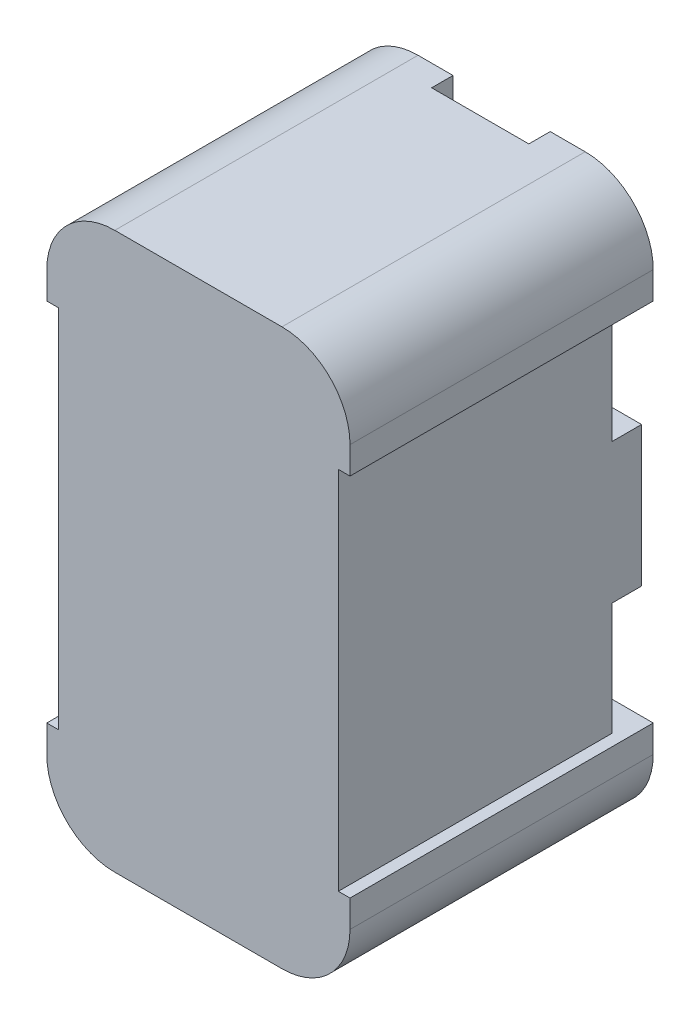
ISO-10303-21;
HEADER;
FILE_DESCRIPTION(('STEP AP214'),'2;1');
FILE_NAME('part.step','',(''),(''),'','','');
FILE_SCHEMA(('AUTOMOTIVE_DESIGN { 1 0 10303 214 1 1 1 1 }'));
ENDSEC;
DATA;
#1=APPLICATION_CONTEXT('core data for automotive mechanical design processes');
#2=APPLICATION_PROTOCOL_DEFINITION('international standard','automotive_design',2000,#1);
#3=PRODUCT_CONTEXT('',#1,'mechanical');
#4=PRODUCT('Part','Part','',(#3));
#5=PRODUCT_RELATED_PRODUCT_CATEGORY('part','',(#4));
#6=PRODUCT_DEFINITION_FORMATION('','',#4);
#7=PRODUCT_DEFINITION_CONTEXT('part definition',#1,'design');
#8=PRODUCT_DEFINITION('design','',#6,#7);
#9=PRODUCT_DEFINITION_SHAPE('','',#8);
#10=(LENGTH_UNIT() NAMED_UNIT(*) SI_UNIT(.MILLI.,.METRE.));
#11=(NAMED_UNIT(*) PLANE_ANGLE_UNIT() SI_UNIT($,.RADIAN.));
#12=(NAMED_UNIT(*) SI_UNIT($,.STERADIAN.) SOLID_ANGLE_UNIT());
#13=UNCERTAINTY_MEASURE_WITH_UNIT(LENGTH_MEASURE(1.E-05),#10,'distance_accuracy_value','');
#14=(GEOMETRIC_REPRESENTATION_CONTEXT(3) GLOBAL_UNCERTAINTY_ASSIGNED_CONTEXT((#13)) GLOBAL_UNIT_ASSIGNED_CONTEXT((#10,
#11,#12)) REPRESENTATION_CONTEXT('',''));
#15=CARTESIAN_POINT('',(0.,0.,0.));
#16=DIRECTION('',(0.,0.,1.));
#17=DIRECTION('',(1.,0.,0.));
#18=AXIS2_PLACEMENT_3D('',#15,#16,#17);
#19=CARTESIAN_POINT('',(60.0000000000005,295.,-11.4));
#20=DIRECTION('',(0.,0.,-0.999999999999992));
#21=DIRECTION('',(0.,1.,0.));
#22=AXIS2_PLACEMENT_3D('',#19,#20,#21);
#23=PLANE('',#22);
#24=DIRECTION('',(1.,0.,0.));
#25=VECTOR('',#24,1.);
#26=CARTESIAN_POINT('',(64.3000000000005,309.3,-11.4));
#27=LINE('',#26,#25);
#28=CARTESIAN_POINT('',(64.3000000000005,309.3,-11.4));
#29=VERTEX_POINT('',#28);
#30=CARTESIAN_POINT('',(62.5000000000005,309.3,-11.4));
#31=VERTEX_POINT('',#30);
#32=EDGE_CURVE('E680',#29,#31,#27,.F.);
#33=ORIENTED_EDGE('',*,*,#32,.F.);
#34=CARTESIAN_POINT('',(64.3000000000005,305.8,-11.4));
#35=DIRECTION('',(0.,0.,-0.999999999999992));
#36=DIRECTION('',(0.,1.,0.));
#37=AXIS2_PLACEMENT_3D('',#34,#35,#36);
#38=CIRCLE('',#37,3.5);
#39=CARTESIAN_POINT('',(67.8000000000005,305.8,-11.4));
#40=VERTEX_POINT('',#39);
#41=EDGE_CURVE('E12',#29,#40,#38,.T.);
#42=ORIENTED_EDGE('',*,*,#41,.T.);
#43=DIRECTION('',(0.,1.,0.));
#44=VECTOR('',#43,1.);
#45=CARTESIAN_POINT('',(67.8000000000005,309.3,-11.4));
#46=LINE('',#45,#44);
#47=CARTESIAN_POINT('',(67.8000000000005,304.4,-11.4));
#48=VERTEX_POINT('',#47);
#49=EDGE_CURVE('E501',#48,#40,#46,.T.);
#50=ORIENTED_EDGE('',*,*,#49,.F.);
#51=DIRECTION('',(1.,0.,0.));
#52=VECTOR('',#51,1.);
#53=CARTESIAN_POINT('',(60.0000000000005,304.4,-11.4));
#54=LINE('',#53,#52);
#55=CARTESIAN_POINT('',(64.5000000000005,304.4,-11.4));
#56=VERTEX_POINT('',#55);
#57=EDGE_CURVE('E962',#48,#56,#54,.F.);
#58=ORIENTED_EDGE('',*,*,#57,.T.);
#59=DIRECTION('',(0.,1.,0.));
#60=VECTOR('',#59,1.);
#61=CARTESIAN_POINT('',(64.5000000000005,295.,-11.4));
#62=LINE('',#61,#60);
#63=CARTESIAN_POINT('',(64.5000000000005,306.3,-11.4));
#64=VERTEX_POINT('',#63);
#65=EDGE_CURVE('E557',#56,#64,#62,.T.);
#66=ORIENTED_EDGE('',*,*,#65,.T.);
#67=CARTESIAN_POINT('',(63.8000000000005,306.3,-11.4));
#68=DIRECTION('',(0.,0.,-0.999999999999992));
#69=DIRECTION('',(0.,1.,0.));
#70=AXIS2_PLACEMENT_3D('',#67,#68,#69);
#71=CIRCLE('',#70,0.699999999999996);
#72=CARTESIAN_POINT('',(63.1000000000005,306.3,-11.4));
#73=VERTEX_POINT('',#72);
#74=EDGE_CURVE('E1139',#64,#73,#71,.F.);
#75=ORIENTED_EDGE('',*,*,#74,.T.);
#76=DIRECTION('',(0.,1.,0.));
#77=VECTOR('',#76,1.);
#78=CARTESIAN_POINT('',(63.1000000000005,295.,-11.4));
#79=LINE('',#78,#77);
#80=CARTESIAN_POINT('',(63.1000000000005,299.5,-11.4));
#81=VERTEX_POINT('',#80);
#82=EDGE_CURVE('E570',#73,#81,#79,.F.);
#83=ORIENTED_EDGE('',*,*,#82,.T.);
#84=DIRECTION('',(1.,0.,0.));
#85=VECTOR('',#84,1.);
#86=CARTESIAN_POINT('',(55.5000000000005,299.5,-11.4));
#87=LINE('',#86,#85);
#88=CARTESIAN_POINT('',(62.5000000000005,299.5,-11.4));
#89=VERTEX_POINT('',#88);
#90=EDGE_CURVE('E636',#89,#81,#87,.T.);
#91=ORIENTED_EDGE('',*,*,#90,.F.);
#92=DIRECTION('',(0.,1.,0.));
#93=VECTOR('',#92,1.);
#94=CARTESIAN_POINT('',(62.5000000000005,299.5,-11.4));
#95=LINE('',#94,#93);
#96=EDGE_CURVE('E455',#89,#31,#95,.T.);
#97=ORIENTED_EDGE('',*,*,#96,.T.);
#98=EDGE_LOOP('',(#33,#42,#50,#58,#66,#75,#83,#91,#97));
#99=FACE_BOUND('',#98,.T.);
#100=ADVANCED_FACE('F45',(#99),#23,.T.);
#101=DIRECTION('',(1.,0.,0.));
#102=VECTOR('',#101,1.);
#103=CARTESIAN_POINT('',(55.7000000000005,280.7,-11.3999999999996));
#104=LINE('',#103,#102);
#105=CARTESIAN_POINT('',(55.7000000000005,280.7,-11.3999999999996));
#106=VERTEX_POINT('',#105);
#107=CARTESIAN_POINT('',(57.5000000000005,280.7,-11.3999999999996));
#108=VERTEX_POINT('',#107);
#109=EDGE_CURVE('E635',#106,#108,#104,.T.);
#110=ORIENTED_EDGE('',*,*,#109,.F.);
#111=CARTESIAN_POINT('',(55.7000000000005,284.2,-11.4));
#112=DIRECTION('',(0.,0.,-0.999999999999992));
#113=DIRECTION('',(0.,1.,0.));
#114=AXIS2_PLACEMENT_3D('',#111,#112,#113);
#115=CIRCLE('',#114,3.5);
#116=CARTESIAN_POINT('',(52.2000000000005,284.2,-11.4));
#117=VERTEX_POINT('',#116);
#118=EDGE_CURVE('E656',#106,#117,#115,.T.);
#119=ORIENTED_EDGE('',*,*,#118,.T.);
#120=DIRECTION('',(0.,-1.,0.));
#121=VECTOR('',#120,1.);
#122=CARTESIAN_POINT('',(52.2000000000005,280.7,-11.3999999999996));
#123=LINE('',#122,#121);
#124=CARTESIAN_POINT('',(52.2000000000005,285.6,-11.4));
#125=VERTEX_POINT('',#124);
#126=EDGE_CURVE('E529',#125,#117,#123,.T.);
#127=ORIENTED_EDGE('',*,*,#126,.F.);
#128=DIRECTION('',(1.,0.,0.));
#129=VECTOR('',#128,1.);
#130=CARTESIAN_POINT('',(52.8000000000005,285.6,-11.4));
#131=LINE('',#130,#129);
#132=CARTESIAN_POINT('',(55.5000000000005,285.6,-11.4));
#133=VERTEX_POINT('',#132);
#134=EDGE_CURVE('E982',#133,#125,#131,.F.);
#135=ORIENTED_EDGE('',*,*,#134,.F.);
#136=DIRECTION('',(0.,1.,0.));
#137=VECTOR('',#136,1.);
#138=CARTESIAN_POINT('',(55.5000000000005,295.,-11.4));
#139=LINE('',#138,#137);
#140=CARTESIAN_POINT('',(55.5000000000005,283.7,-11.4));
#141=VERTEX_POINT('',#140);
#142=EDGE_CURVE('E751',#133,#141,#139,.F.);
#143=ORIENTED_EDGE('',*,*,#142,.T.);
#144=CARTESIAN_POINT('',(56.2000000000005,283.7,-11.4));
#145=DIRECTION('',(0.,0.,0.999999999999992));
#146=DIRECTION('',(0.,-1.,0.));
#147=AXIS2_PLACEMENT_3D('',#144,#145,#146);
#148=CIRCLE('',#147,0.699999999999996);
#149=CARTESIAN_POINT('',(56.9000000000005,283.7,-11.4));
#150=VERTEX_POINT('',#149);
#151=EDGE_CURVE('E888',#141,#150,#148,.T.);
#152=ORIENTED_EDGE('',*,*,#151,.T.);
#153=DIRECTION('',(0.,1.,0.));
#154=VECTOR('',#153,1.);
#155=CARTESIAN_POINT('',(56.9000000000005,295.,-11.4));
#156=LINE('',#155,#154);
#157=CARTESIAN_POINT('',(56.9000000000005,290.5,-11.4));
#158=VERTEX_POINT('',#157);
#159=EDGE_CURVE('E644',#150,#158,#156,.T.);
#160=ORIENTED_EDGE('',*,*,#159,.T.);
#161=DIRECTION('',(1.,0.,0.));
#162=VECTOR('',#161,1.);
#163=CARTESIAN_POINT('',(60.0000000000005,290.5,-11.4));
#164=LINE('',#163,#162);
#165=CARTESIAN_POINT('',(57.5000000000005,290.5,-11.4));
#166=VERTEX_POINT('',#165);
#167=EDGE_CURVE('E611',#158,#166,#164,.T.);
#168=ORIENTED_EDGE('',*,*,#167,.T.);
#169=DIRECTION('',(0.,-1.,0.));
#170=VECTOR('',#169,1.);
#171=CARTESIAN_POINT('',(57.5000000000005,290.5,-11.4));
#172=LINE('',#171,#170);
#173=EDGE_CURVE('E481',#166,#108,#172,.T.);
#174=ORIENTED_EDGE('',*,*,#173,.T.);
#175=EDGE_LOOP('',(#110,#119,#127,#135,#143,#152,#160,#168,#174));
#176=FACE_BOUND('',#175,.T.);
#177=ADVANCED_FACE('F711',(#176),#23,.T.);
#178=CARTESIAN_POINT('',(67.2000000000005,285.6,4.19999999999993));
#179=DIRECTION('',(1.,0.,0.));
#180=DIRECTION('',(0.,1.,0.));
#181=AXIS2_PLACEMENT_3D('',#178,#179,#180);
#182=PLANE('',#181);
#183=DIRECTION('',(0.,1.,0.));
#184=VECTOR('',#183,1.);
#185=CARTESIAN_POINT('',(67.2000000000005,285.6,-9.88161785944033));
#186=LINE('',#185,#184);
#187=CARTESIAN_POINT('',(67.2000000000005,298.6,-9.88161785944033));
#188=VERTEX_POINT('',#187);
#189=CARTESIAN_POINT('',(67.2000000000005,304.4,-9.88161785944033));
#190=VERTEX_POINT('',#189);
#191=EDGE_CURVE('E970',#188,#190,#186,.T.);
#192=ORIENTED_EDGE('',*,*,#191,.T.);
#193=DIRECTION('',(0.,0.,-0.999999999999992));
#194=VECTOR('',#193,1.);
#195=CARTESIAN_POINT('',(67.2000000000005,304.4,-11.4));
#196=LINE('',#195,#194);
#197=CARTESIAN_POINT('',(67.2000000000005,304.4,4.19999999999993));
#198=VERTEX_POINT('',#197);
#199=EDGE_CURVE('E491',#198,#190,#196,.T.);
#200=ORIENTED_EDGE('',*,*,#199,.F.);
#201=DIRECTION('',(0.,1.,0.));
#202=VECTOR('',#201,1.);
#203=CARTESIAN_POINT('',(67.2000000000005,295.,4.19999999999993));
#204=LINE('',#203,#202);
#205=CARTESIAN_POINT('',(67.2000000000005,285.6,4.19999999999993));
#206=VERTEX_POINT('',#205);
#207=EDGE_CURVE('E627',#198,#206,#204,.F.);
#208=ORIENTED_EDGE('',*,*,#207,.T.);
#209=DIRECTION('',(0.,0.,0.999999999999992));
#210=VECTOR('',#209,1.);
#211=CARTESIAN_POINT('',(67.2000000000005,285.6,4.19999999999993));
#212=LINE('',#211,#210);
#213=CARTESIAN_POINT('',(67.2000000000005,285.6,-9.88161785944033));
#214=VERTEX_POINT('',#213);
#215=EDGE_CURVE('E551',#214,#206,#212,.T.);
#216=ORIENTED_EDGE('',*,*,#215,.F.);
#217=DIRECTION('',(0.,1.,0.));
#218=VECTOR('',#217,1.);
#219=CARTESIAN_POINT('',(67.2000000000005,285.6,-9.88161785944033));
#220=LINE('',#219,#218);
#221=CARTESIAN_POINT('',(67.2000000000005,291.4,-9.88161785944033));
#222=VERTEX_POINT('',#221);
#223=EDGE_CURVE('E565',#214,#222,#220,.T.);
#224=ORIENTED_EDGE('',*,*,#223,.T.);
#225=DIRECTION('',(0.,0.,0.999999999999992));
#226=VECTOR('',#225,1.);
#227=CARTESIAN_POINT('',(67.2000000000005,291.4,-10.3967778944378));
#228=LINE('',#227,#226);
#229=CARTESIAN_POINT('',(67.2000000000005,291.4,-11.4));
#230=VERTEX_POINT('',#229);
#231=EDGE_CURVE('E820',#222,#230,#228,.F.);
#232=ORIENTED_EDGE('',*,*,#231,.T.);
#233=DIRECTION('',(0.,1.,0.));
#234=VECTOR('',#233,1.);
#235=CARTESIAN_POINT('',(67.2000000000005,285.6,-11.4));
#236=LINE('',#235,#234);
#237=CARTESIAN_POINT('',(67.2000000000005,298.6,-11.4));
#238=VERTEX_POINT('',#237);
#239=EDGE_CURVE('E569',#230,#238,#236,.T.);
#240=ORIENTED_EDGE('',*,*,#239,.T.);
#241=DIRECTION('',(0.,0.,0.999999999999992));
#242=VECTOR('',#241,1.);
#243=CARTESIAN_POINT('',(67.2000000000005,298.6,-10.3967778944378));
#244=LINE('',#243,#242);
#245=EDGE_CURVE('E562',#188,#238,#244,.F.);
#246=ORIENTED_EDGE('',*,*,#245,.F.);
#247=EDGE_LOOP('',(#192,#200,#208,#216,#224,#232,#240,#246));
#248=FACE_BOUND('',#247,.T.);
#249=ADVANCED_FACE('F949',(#248),#182,.T.);
#250=CARTESIAN_POINT('',(52.8000000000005,304.4,4.19999999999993));
#251=DIRECTION('',(-1.,0.,0.));
#252=DIRECTION('',(0.,-1.,0.));
#253=AXIS2_PLACEMENT_3D('',#250,#251,#252);
#254=PLANE('',#253);
#255=DIRECTION('',(0.,1.,0.));
#256=VECTOR('',#255,1.);
#257=CARTESIAN_POINT('',(52.8000000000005,295.,4.19999999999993));
#258=LINE('',#257,#256);
#259=CARTESIAN_POINT('',(52.8000000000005,285.6,4.19999999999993));
#260=VERTEX_POINT('',#259);
#261=CARTESIAN_POINT('',(52.8000000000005,304.4,4.19999999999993));
#262=VERTEX_POINT('',#261);
#263=EDGE_CURVE('E573',#260,#262,#258,.T.);
#264=ORIENTED_EDGE('',*,*,#263,.T.);
#265=DIRECTION('',(0.,0.,0.999999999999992));
#266=VECTOR('',#265,1.);
#267=CARTESIAN_POINT('',(52.8000000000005,304.4,4.19999999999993));
#268=LINE('',#267,#266);
#269=CARTESIAN_POINT('',(52.8000000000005,304.4,-9.88161785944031));
#270=VERTEX_POINT('',#269);
#271=EDGE_CURVE('E515',#270,#262,#268,.T.);
#272=ORIENTED_EDGE('',*,*,#271,.F.);
#273=DIRECTION('',(0.,-1.,0.));
#274=VECTOR('',#273,1.);
#275=CARTESIAN_POINT('',(52.8000000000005,304.4,-9.88161785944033));
#276=LINE('',#275,#274);
#277=CARTESIAN_POINT('',(52.8000000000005,298.6,-9.88161785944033));
#278=VERTEX_POINT('',#277);
#279=EDGE_CURVE('E651',#270,#278,#276,.T.);
#280=ORIENTED_EDGE('',*,*,#279,.T.);
#281=DIRECTION('',(0.,0.,0.999999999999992));
#282=VECTOR('',#281,1.);
#283=CARTESIAN_POINT('',(52.8000000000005,298.6,-10.3967778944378));
#284=LINE('',#283,#282);
#285=CARTESIAN_POINT('',(52.8000000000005,298.6,-11.4));
#286=VERTEX_POINT('',#285);
#287=EDGE_CURVE('E828',#286,#278,#284,.T.);
#288=ORIENTED_EDGE('',*,*,#287,.F.);
#289=DIRECTION('',(0.,-1.,0.));
#290=VECTOR('',#289,1.);
#291=CARTESIAN_POINT('',(52.8000000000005,304.4,-11.4));
#292=LINE('',#291,#290);
#293=CARTESIAN_POINT('',(52.8000000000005,291.4,-11.4));
#294=VERTEX_POINT('',#293);
#295=EDGE_CURVE('E692',#286,#294,#292,.T.);
#296=ORIENTED_EDGE('',*,*,#295,.T.);
#297=DIRECTION('',(0.,0.,0.999999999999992));
#298=VECTOR('',#297,1.);
#299=CARTESIAN_POINT('',(52.8000000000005,291.4,-10.3967778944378));
#300=LINE('',#299,#298);
#301=CARTESIAN_POINT('',(52.8000000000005,291.4,-9.88161785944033));
#302=VERTEX_POINT('',#301);
#303=EDGE_CURVE('E990',#294,#302,#300,.T.);
#304=ORIENTED_EDGE('',*,*,#303,.T.);
#305=DIRECTION('',(0.,-1.,0.));
#306=VECTOR('',#305,1.);
#307=CARTESIAN_POINT('',(52.8000000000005,304.4,-9.88161785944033));
#308=LINE('',#307,#306);
#309=CARTESIAN_POINT('',(52.8000000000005,285.6,-9.88161785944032));
#310=VERTEX_POINT('',#309);
#311=EDGE_CURVE('E942',#302,#310,#308,.T.);
#312=ORIENTED_EDGE('',*,*,#311,.T.);
#313=DIRECTION('',(0.,0.,-0.999999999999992));
#314=VECTOR('',#313,1.);
#315=CARTESIAN_POINT('',(52.8000000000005,285.6,-11.4));
#316=LINE('',#315,#314);
#317=EDGE_CURVE('E525',#260,#310,#316,.T.);
#318=ORIENTED_EDGE('',*,*,#317,.F.);
#319=EDGE_LOOP('',(#264,#272,#280,#288,#296,#304,#312,#318));
#320=FACE_BOUND('',#319,.T.);
#321=ADVANCED_FACE('F862',(#320),#254,.T.);
#322=DIRECTION('',(0.,-1.,0.));
#323=VECTOR('',#322,1.);
#324=CARTESIAN_POINT('',(52.2000000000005,304.4,-11.4));
#325=LINE('',#324,#323);
#326=CARTESIAN_POINT('',(52.2000000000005,305.8,-11.4));
#327=VERTEX_POINT('',#326);
#328=CARTESIAN_POINT('',(52.2000000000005,304.4,-11.4));
#329=VERTEX_POINT('',#328);
#330=EDGE_CURVE('E512',#327,#329,#325,.T.);
#331=ORIENTED_EDGE('',*,*,#330,.F.);
#332=CARTESIAN_POINT('',(55.7000000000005,305.8,-11.4));
#333=DIRECTION('',(0.,0.,-0.999999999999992));
#334=DIRECTION('',(0.,1.,0.));
#335=AXIS2_PLACEMENT_3D('',#332,#333,#334);
#336=CIRCLE('',#335,3.5);
#337=CARTESIAN_POINT('',(55.7000000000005,309.3,-11.4));
#338=VERTEX_POINT('',#337);
#339=EDGE_CURVE('E670',#327,#338,#336,.T.);
#340=ORIENTED_EDGE('',*,*,#339,.T.);
#341=CARTESIAN_POINT('',(57.5000000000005,309.3,-11.4));
#342=VERTEX_POINT('',#341);
#343=EDGE_CURVE('E683',#342,#338,#27,.F.);
#344=ORIENTED_EDGE('',*,*,#343,.F.);
#345=DIRECTION('',(0.,1.,0.));
#346=VECTOR('',#345,1.);
#347=CARTESIAN_POINT('',(57.5000000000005,299.5,-11.4));
#348=LINE('',#347,#346);
#349=CARTESIAN_POINT('',(57.5000000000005,299.5,-11.4));
#350=VERTEX_POINT('',#349);
#351=EDGE_CURVE('E468',#350,#342,#348,.T.);
#352=ORIENTED_EDGE('',*,*,#351,.F.);
#353=CARTESIAN_POINT('',(56.9000000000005,299.5,-11.4));
#354=VERTEX_POINT('',#353);
#355=EDGE_CURVE('E1057',#354,#350,#87,.T.);
#356=ORIENTED_EDGE('',*,*,#355,.F.);
#357=DIRECTION('',(0.,1.,0.));
#358=VECTOR('',#357,1.);
#359=CARTESIAN_POINT('',(56.9000000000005,295.,-11.4));
#360=LINE('',#359,#358);
#361=CARTESIAN_POINT('',(56.9000000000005,306.3,-11.4));
#362=VERTEX_POINT('',#361);
#363=EDGE_CURVE('E808',#354,#362,#360,.T.);
#364=ORIENTED_EDGE('',*,*,#363,.T.);
#365=CARTESIAN_POINT('',(56.2000000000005,306.3,-11.4));
#366=DIRECTION('',(0.,0.,-0.999999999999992));
#367=DIRECTION('',(0.,1.,0.));
#368=AXIS2_PLACEMENT_3D('',#365,#366,#367);
#369=CIRCLE('',#368,0.699999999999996);
#370=CARTESIAN_POINT('',(55.5000000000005,306.3,-11.4));
#371=VERTEX_POINT('',#370);
#372=EDGE_CURVE('E904',#362,#371,#369,.F.);
#373=ORIENTED_EDGE('',*,*,#372,.T.);
#374=DIRECTION('',(0.,1.,0.));
#375=VECTOR('',#374,1.);
#376=CARTESIAN_POINT('',(55.5000000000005,295.,-11.4));
#377=LINE('',#376,#375);
#378=CARTESIAN_POINT('',(55.5000000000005,304.4,-11.4));
#379=VERTEX_POINT('',#378);
#380=EDGE_CURVE('E809',#371,#379,#377,.F.);
#381=ORIENTED_EDGE('',*,*,#380,.T.);
#382=DIRECTION('',(1.,0.,0.));
#383=VECTOR('',#382,1.);
#384=CARTESIAN_POINT('',(60.0000000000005,304.4,-11.4));
#385=LINE('',#384,#383);
#386=EDGE_CURVE('E804',#379,#329,#385,.F.);
#387=ORIENTED_EDGE('',*,*,#386,.T.);
#388=EDGE_LOOP('',(#331,#340,#344,#352,#356,#364,#373,#381,#387));
#389=FACE_BOUND('',#388,.T.);
#390=ADVANCED_FACE('F1243',(#389),#23,.T.);
#391=DIRECTION('',(1.,0.,0.));
#392=VECTOR('',#391,1.);
#393=CARTESIAN_POINT('',(54.7000000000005,297.5,-11.4));
#394=LINE('',#393,#392);
#395=CARTESIAN_POINT('',(54.7000000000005,297.5,-11.4));
#396=VERTEX_POINT('',#395);
#397=CARTESIAN_POINT('',(65.3000000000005,297.5,-11.4));
#398=VERTEX_POINT('',#397);
#399=EDGE_CURVE('E410',#396,#398,#394,.T.);
#400=ORIENTED_EDGE('',*,*,#399,.F.);
#401=DIRECTION('',(0.,1.,0.));
#402=VECTOR('',#401,1.);
#403=CARTESIAN_POINT('',(54.7000000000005,292.5,-11.4));
#404=LINE('',#403,#402);
#405=CARTESIAN_POINT('',(54.7000000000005,292.5,-11.4));
#406=VERTEX_POINT('',#405);
#407=EDGE_CURVE('E427',#406,#396,#404,.T.);
#408=ORIENTED_EDGE('',*,*,#407,.F.);
#409=DIRECTION('',(-1.,0.,0.));
#410=VECTOR('',#409,1.);
#411=CARTESIAN_POINT('',(65.3000000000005,292.5,-11.4));
#412=LINE('',#411,#410);
#413=CARTESIAN_POINT('',(65.3000000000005,292.5,-11.4));
#414=VERTEX_POINT('',#413);
#415=EDGE_CURVE('E430',#414,#406,#412,.T.);
#416=ORIENTED_EDGE('',*,*,#415,.F.);
#417=DIRECTION('',(0.,-1.,0.));
#418=VECTOR('',#417,1.);
#419=CARTESIAN_POINT('',(65.3000000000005,297.5,-11.4));
#420=LINE('',#419,#418);
#421=EDGE_CURVE('E436',#398,#414,#420,.T.);
#422=ORIENTED_EDGE('',*,*,#421,.F.);
#423=EDGE_LOOP('',(#400,#408,#416,#422));
#424=FACE_BOUND('',#423,.T.);
#425=CARTESIAN_POINT('',(64.5000000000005,298.1,-11.4));
#426=VERTEX_POINT('',#425);
#427=CARTESIAN_POINT('',(64.5000000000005,298.6,-11.4));
#428=VERTEX_POINT('',#427);
#429=EDGE_CURVE('E959',#426,#428,#62,.T.);
#430=ORIENTED_EDGE('',*,*,#429,.T.);
#431=DIRECTION('',(1.,0.,0.));
#432=VECTOR('',#431,1.);
#433=CARTESIAN_POINT('',(60.0000000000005,298.6,-11.4));
#434=LINE('',#433,#432);
#435=EDGE_CURVE('E957',#428,#238,#434,.T.);
#436=ORIENTED_EDGE('',*,*,#435,.T.);
#437=ORIENTED_EDGE('',*,*,#239,.F.);
#438=DIRECTION('',(1.,0.,0.));
#439=VECTOR('',#438,1.);
#440=CARTESIAN_POINT('',(60.0000000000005,291.4,-11.4));
#441=LINE('',#440,#439);
#442=CARTESIAN_POINT('',(64.5000000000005,291.4,-11.4));
#443=VERTEX_POINT('',#442);
#444=EDGE_CURVE('E955',#230,#443,#441,.F.);
#445=ORIENTED_EDGE('',*,*,#444,.T.);
#446=DIRECTION('',(0.,1.,0.));
#447=VECTOR('',#446,1.);
#448=CARTESIAN_POINT('',(64.5000000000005,291.4,-11.4));
#449=LINE('',#448,#447);
#450=CARTESIAN_POINT('',(64.5000000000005,291.9,-11.4));
#451=VERTEX_POINT('',#450);
#452=EDGE_CURVE('E921',#443,#451,#449,.T.);
#453=ORIENTED_EDGE('',*,*,#452,.T.);
#454=DIRECTION('',(1.,0.,0.));
#455=VECTOR('',#454,1.);
#456=CARTESIAN_POINT('',(60.0000000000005,291.9,-11.4));
#457=LINE('',#456,#455);
#458=CARTESIAN_POINT('',(55.5000000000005,291.9,-11.4));
#459=VERTEX_POINT('',#458);
#460=EDGE_CURVE('E836',#451,#459,#457,.F.);
#461=ORIENTED_EDGE('',*,*,#460,.T.);
#462=CARTESIAN_POINT('',(55.5000000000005,291.4,-11.4));
#463=VERTEX_POINT('',#462);
#464=EDGE_CURVE('E879',#459,#463,#139,.F.);
#465=ORIENTED_EDGE('',*,*,#464,.T.);
#466=DIRECTION('',(1.,0.,0.));
#467=VECTOR('',#466,1.);
#468=CARTESIAN_POINT('',(60.0000000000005,291.4,-11.4));
#469=LINE('',#468,#467);
#470=EDGE_CURVE('E979',#463,#294,#469,.F.);
#471=ORIENTED_EDGE('',*,*,#470,.T.);
#472=ORIENTED_EDGE('',*,*,#295,.F.);
#473=DIRECTION('',(1.,0.,0.));
#474=VECTOR('',#473,1.);
#475=CARTESIAN_POINT('',(60.0000000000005,298.6,-11.4));
#476=LINE('',#475,#474);
#477=CARTESIAN_POINT('',(55.5000000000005,298.6,-11.4));
#478=VERTEX_POINT('',#477);
#479=EDGE_CURVE('E1171',#286,#478,#476,.T.);
#480=ORIENTED_EDGE('',*,*,#479,.T.);
#481=DIRECTION('',(0.,1.,0.));
#482=VECTOR('',#481,1.);
#483=CARTESIAN_POINT('',(55.5000000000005,295.,-11.4));
#484=LINE('',#483,#482);
#485=CARTESIAN_POINT('',(55.5000000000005,298.1,-11.4));
#486=VERTEX_POINT('',#485);
#487=EDGE_CURVE('E1168',#478,#486,#484,.F.);
#488=ORIENTED_EDGE('',*,*,#487,.T.);
#489=DIRECTION('',(1.,0.,0.));
#490=VECTOR('',#489,1.);
#491=CARTESIAN_POINT('',(60.0000000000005,298.1,-11.4));
#492=LINE('',#491,#490);
#493=EDGE_CURVE('E1167',#486,#426,#492,.T.);
#494=ORIENTED_EDGE('',*,*,#493,.T.);
#495=EDGE_LOOP('',(#430,#436,#437,#445,#453,#461,#465,#471,#472,#480,#488,#494));
#496=FACE_BOUND('',#495,.T.);
#497=ADVANCED_FACE('F954',(#424,#496),#23,.T.);
#498=DIRECTION('',(0.,1.,0.));
#499=VECTOR('',#498,1.);
#500=CARTESIAN_POINT('',(67.8000000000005,285.6,-11.4));
#501=LINE('',#500,#499);
#502=CARTESIAN_POINT('',(67.8000000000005,284.2,-11.4));
#503=VERTEX_POINT('',#502);
#504=CARTESIAN_POINT('',(67.8000000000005,285.6,-11.4));
#505=VERTEX_POINT('',#504);
#506=EDGE_CURVE('E538',#503,#505,#501,.T.);
#507=ORIENTED_EDGE('',*,*,#506,.F.);
#508=CARTESIAN_POINT('',(64.3000000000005,284.2,-11.4));
#509=DIRECTION('',(0.,0.,-0.999999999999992));
#510=DIRECTION('',(0.,1.,0.));
#511=AXIS2_PLACEMENT_3D('',#508,#509,#510);
#512=CIRCLE('',#511,3.5);
#513=CARTESIAN_POINT('',(64.3000000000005,280.7,-11.3999999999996));
#514=VERTEX_POINT('',#513);
#515=EDGE_CURVE('E661',#503,#514,#512,.T.);
#516=ORIENTED_EDGE('',*,*,#515,.T.);
#517=CARTESIAN_POINT('',(62.5000000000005,280.7,-11.3999999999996));
#518=VERTEX_POINT('',#517);
#519=EDGE_CURVE('E630',#518,#514,#104,.T.);
#520=ORIENTED_EDGE('',*,*,#519,.F.);
#521=DIRECTION('',(0.,-1.,0.));
#522=VECTOR('',#521,1.);
#523=CARTESIAN_POINT('',(62.5000000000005,290.5,-11.4));
#524=LINE('',#523,#522);
#525=CARTESIAN_POINT('',(62.5000000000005,290.5,-11.4));
#526=VERTEX_POINT('',#525);
#527=EDGE_CURVE('E494',#526,#518,#524,.T.);
#528=ORIENTED_EDGE('',*,*,#527,.F.);
#529=CARTESIAN_POINT('',(63.1000000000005,290.5,-11.4));
#530=VERTEX_POINT('',#529);
#531=EDGE_CURVE('E616',#526,#530,#164,.T.);
#532=ORIENTED_EDGE('',*,*,#531,.T.);
#533=DIRECTION('',(0.,1.,0.));
#534=VECTOR('',#533,1.);
#535=CARTESIAN_POINT('',(63.1000000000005,295.,-11.4));
#536=LINE('',#535,#534);
#537=CARTESIAN_POINT('',(63.1000000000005,283.7,-11.4));
#538=VERTEX_POINT('',#537);
#539=EDGE_CURVE('E615',#530,#538,#536,.F.);
#540=ORIENTED_EDGE('',*,*,#539,.T.);
#541=CARTESIAN_POINT('',(63.8000000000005,283.7,-11.4));
#542=DIRECTION('',(0.,0.,0.999999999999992));
#543=DIRECTION('',(0.,-1.,0.));
#544=AXIS2_PLACEMENT_3D('',#541,#542,#543);
#545=CIRCLE('',#544,0.699999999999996);
#546=CARTESIAN_POINT('',(64.5000000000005,283.7,-11.4));
#547=VERTEX_POINT('',#546);
#548=EDGE_CURVE('E747',#538,#547,#545,.T.);
#549=ORIENTED_EDGE('',*,*,#548,.T.);
#550=DIRECTION('',(0.,1.,0.));
#551=VECTOR('',#550,1.);
#552=CARTESIAN_POINT('',(64.5000000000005,295.,-11.4));
#553=LINE('',#552,#551);
#554=CARTESIAN_POINT('',(64.5000000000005,285.6,-11.4));
#555=VERTEX_POINT('',#554);
#556=EDGE_CURVE('E759',#547,#555,#553,.T.);
#557=ORIENTED_EDGE('',*,*,#556,.T.);
#558=DIRECTION('',(1.,0.,0.));
#559=VECTOR('',#558,1.);
#560=CARTESIAN_POINT('',(60.0000000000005,285.6,-11.4));
#561=LINE('',#560,#559);
#562=EDGE_CURVE('E626',#555,#505,#561,.T.);
#563=ORIENTED_EDGE('',*,*,#562,.T.);
#564=EDGE_LOOP('',(#507,#516,#520,#528,#532,#540,#549,#557,#563));
#565=FACE_BOUND('',#564,.T.);
#566=ADVANCED_FACE('F730',(#565),#23,.T.);
#567=CARTESIAN_POINT('',(60.0000000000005,295.,4.19999999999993));
#568=DIRECTION('',(0.,0.,-0.999999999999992));
#569=DIRECTION('',(0.,1.,0.));
#570=AXIS2_PLACEMENT_3D('',#567,#568,#569);
#571=PLANE('',#570);
#572=DIRECTION('',(0.,-1.,0.));
#573=VECTOR('',#572,1.);
#574=CARTESIAN_POINT('',(67.8000000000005,304.4,4.19999999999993));
#575=LINE('',#574,#573);
#576=CARTESIAN_POINT('',(67.8000000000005,305.8,4.19999999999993));
#577=VERTEX_POINT('',#576);
#578=CARTESIAN_POINT('',(67.8000000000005,304.4,4.19999999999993));
#579=VERTEX_POINT('',#578);
#580=EDGE_CURVE('E504',#577,#579,#575,.T.);
#581=ORIENTED_EDGE('',*,*,#580,.F.);
#582=CARTESIAN_POINT('',(64.3000000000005,305.8,4.19999999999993));
#583=DIRECTION('',(0.,0.,-0.999999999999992));
#584=DIRECTION('',(0.,1.,0.));
#585=AXIS2_PLACEMENT_3D('',#582,#583,#584);
#586=CIRCLE('',#585,3.5);
#587=CARTESIAN_POINT('',(64.3000000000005,309.3,4.19999999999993));
#588=VERTEX_POINT('',#587);
#589=EDGE_CURVE('E67',#577,#588,#586,.F.);
#590=ORIENTED_EDGE('',*,*,#589,.T.);
#591=DIRECTION('',(1.,0.,0.));
#592=VECTOR('',#591,1.);
#593=CARTESIAN_POINT('',(60.0000000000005,309.3,4.19999999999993));
#594=LINE('',#593,#592);
#595=CARTESIAN_POINT('',(55.7000000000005,309.3,4.19999999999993));
#596=VERTEX_POINT('',#595);
#597=EDGE_CURVE('E556',#596,#588,#594,.T.);
#598=ORIENTED_EDGE('',*,*,#597,.F.);
#599=CARTESIAN_POINT('',(55.7000000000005,305.8,4.19999999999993));
#600=DIRECTION('',(0.,0.,-0.999999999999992));
#601=DIRECTION('',(0.,1.,0.));
#602=AXIS2_PLACEMENT_3D('',#599,#600,#601);
#603=CIRCLE('',#602,3.5);
#604=CARTESIAN_POINT('',(52.2000000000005,305.8,4.19999999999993));
#605=VERTEX_POINT('',#604);
#606=EDGE_CURVE('E674',#596,#605,#603,.F.);
#607=ORIENTED_EDGE('',*,*,#606,.T.);
#608=DIRECTION('',(0.,1.,0.));
#609=VECTOR('',#608,1.);
#610=CARTESIAN_POINT('',(52.2000000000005,309.3,4.19999999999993));
#611=LINE('',#610,#609);
#612=CARTESIAN_POINT('',(52.2000000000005,304.4,4.19999999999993));
#613=VERTEX_POINT('',#612);
#614=EDGE_CURVE('E517',#613,#605,#611,.T.);
#615=ORIENTED_EDGE('',*,*,#614,.F.);
#616=DIRECTION('',(1.,0.,0.));
#617=VECTOR('',#616,1.);
#618=CARTESIAN_POINT('',(52.2000000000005,304.4,4.19999999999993));
#619=LINE('',#618,#617);
#620=EDGE_CURVE('E520',#613,#262,#619,.T.);
#621=ORIENTED_EDGE('',*,*,#620,.T.);
#622=ORIENTED_EDGE('',*,*,#263,.F.);
#623=DIRECTION('',(1.,0.,0.));
#624=VECTOR('',#623,1.);
#625=CARTESIAN_POINT('',(52.2000000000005,285.6,4.19999999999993));
#626=LINE('',#625,#624);
#627=CARTESIAN_POINT('',(52.2000000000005,285.6,4.19999999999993));
#628=VERTEX_POINT('',#627);
#629=EDGE_CURVE('E534',#628,#260,#626,.T.);
#630=ORIENTED_EDGE('',*,*,#629,.F.);
#631=DIRECTION('',(0.,1.,0.));
#632=VECTOR('',#631,1.);
#633=CARTESIAN_POINT('',(52.2000000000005,285.6,4.19999999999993));
#634=LINE('',#633,#632);
#635=CARTESIAN_POINT('',(52.2000000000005,284.2,4.19999999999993));
#636=VERTEX_POINT('',#635);
#637=EDGE_CURVE('E532',#636,#628,#634,.T.);
#638=ORIENTED_EDGE('',*,*,#637,.F.);
#639=CARTESIAN_POINT('',(55.7000000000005,284.2,4.19999999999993));
#640=DIRECTION('',(0.,0.,-0.999999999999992));
#641=DIRECTION('',(0.,1.,0.));
#642=AXIS2_PLACEMENT_3D('',#639,#640,#641);
#643=CIRCLE('',#642,3.5);
#644=CARTESIAN_POINT('',(55.7000000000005,280.7,4.19999999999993));
#645=VERTEX_POINT('',#644);
#646=EDGE_CURVE('E652',#636,#645,#643,.F.);
#647=ORIENTED_EDGE('',*,*,#646,.T.);
#648=DIRECTION('',(1.,0.,0.));
#649=VECTOR('',#648,1.);
#650=CARTESIAN_POINT('',(60.0000000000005,280.7,4.19999999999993));
#651=LINE('',#650,#649);
#652=CARTESIAN_POINT('',(64.3000000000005,280.7,4.19999999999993));
#653=VERTEX_POINT('',#652);
#654=EDGE_CURVE('E577',#653,#645,#651,.F.);
#655=ORIENTED_EDGE('',*,*,#654,.F.);
#656=CARTESIAN_POINT('',(64.3000000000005,284.2,4.19999999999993));
#657=DIRECTION('',(0.,0.,-0.999999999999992));
#658=DIRECTION('',(0.,1.,0.));
#659=AXIS2_PLACEMENT_3D('',#656,#657,#658);
#660=CIRCLE('',#659,3.5);
#661=CARTESIAN_POINT('',(67.8000000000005,284.2,4.19999999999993));
#662=VERTEX_POINT('',#661);
#663=EDGE_CURVE('E665',#653,#662,#660,.F.);
#664=ORIENTED_EDGE('',*,*,#663,.T.);
#665=DIRECTION('',(0.,-1.,0.));
#666=VECTOR('',#665,1.);
#667=CARTESIAN_POINT('',(67.8000000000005,280.7,4.19999999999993));
#668=LINE('',#667,#666);
#669=CARTESIAN_POINT('',(67.8000000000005,285.6,4.19999999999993));
#670=VERTEX_POINT('',#669);
#671=EDGE_CURVE('E542',#670,#662,#668,.T.);
#672=ORIENTED_EDGE('',*,*,#671,.F.);
#673=DIRECTION('',(-1.,0.,0.));
#674=VECTOR('',#673,1.);
#675=CARTESIAN_POINT('',(67.8000000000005,285.6,4.19999999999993));
#676=LINE('',#675,#674);
#677=EDGE_CURVE('E545',#670,#206,#676,.T.);
#678=ORIENTED_EDGE('',*,*,#677,.T.);
#679=ORIENTED_EDGE('',*,*,#207,.F.);
#680=DIRECTION('',(-1.,0.,0.));
#681=VECTOR('',#680,1.);
#682=CARTESIAN_POINT('',(67.8000000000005,304.4,4.19999999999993));
#683=LINE('',#682,#681);
#684=EDGE_CURVE('E506',#579,#198,#683,.T.);
#685=ORIENTED_EDGE('',*,*,#684,.F.);
#686=EDGE_LOOP('',(#581,#590,#598,#607,#615,#621,#622,#630,#638,#647,#655,#664,#672,#678,#679,#685));
#687=FACE_BOUND('',#686,.T.);
#688=ADVANCED_FACE('F700',(#687),#571,.F.);
#689=CARTESIAN_POINT('',(55.7000000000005,280.7,4.19999999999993));
#690=DIRECTION('',(0.,-1.,0.));
#691=DIRECTION('',(0.,0.,-0.999999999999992));
#692=AXIS2_PLACEMENT_3D('',#689,#690,#691);
#693=PLANE('',#692);
#694=ORIENTED_EDGE('',*,*,#519,.T.);
#695=DIRECTION('',(0.,0.,-0.999999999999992));
#696=VECTOR('',#695,1.);
#697=CARTESIAN_POINT('',(64.3000000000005,280.7,4.19999999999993));
#698=LINE('',#697,#696);
#699=EDGE_CURVE('E663',#514,#653,#698,.F.);
#700=ORIENTED_EDGE('',*,*,#699,.T.);
#701=ORIENTED_EDGE('',*,*,#654,.T.);
#702=DIRECTION('',(0.,0.,0.999999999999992));
#703=VECTOR('',#702,1.);
#704=CARTESIAN_POINT('',(55.7000000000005,280.7,-11.3999999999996));
#705=LINE('',#704,#703);
#706=EDGE_CURVE('E654',#645,#106,#705,.F.);
#707=ORIENTED_EDGE('',*,*,#706,.T.);
#708=ORIENTED_EDGE('',*,*,#109,.T.);
#709=DIRECTION('',(0.,0.,-0.999999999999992));
#710=VECTOR('',#709,1.);
#711=CARTESIAN_POINT('',(57.5000000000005,280.7,-10.3000000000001));
#712=LINE('',#711,#710);
#713=CARTESIAN_POINT('',(57.5000000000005,280.7,-10.3000000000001));
#714=VERTEX_POINT('',#713);
#715=EDGE_CURVE('E465',#714,#108,#712,.T.);
#716=ORIENTED_EDGE('',*,*,#715,.F.);
#717=DIRECTION('',(-1.,0.,0.));
#718=VECTOR('',#717,1.);
#719=CARTESIAN_POINT('',(62.5000000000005,280.7,-10.3000000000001));
#720=LINE('',#719,#718);
#721=CARTESIAN_POINT('',(62.5000000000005,280.7,-10.3000000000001));
#722=VERTEX_POINT('',#721);
#723=EDGE_CURVE('E475',#722,#714,#720,.T.);
#724=ORIENTED_EDGE('',*,*,#723,.F.);
#725=DIRECTION('',(0.,0.,0.999999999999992));
#726=VECTOR('',#725,1.);
#727=CARTESIAN_POINT('',(62.5000000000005,280.7,-11.3999999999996));
#728=LINE('',#727,#726);
#729=EDGE_CURVE('E484',#518,#722,#728,.T.);
#730=ORIENTED_EDGE('',*,*,#729,.F.);
#731=EDGE_LOOP('',(#694,#700,#701,#707,#708,#716,#724,#730));
#732=FACE_BOUND('',#731,.T.);
#733=ADVANCED_FACE('F708',(#732),#693,.T.);
#734=CARTESIAN_POINT('',(67.8000000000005,285.6,4.19999999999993));
#735=DIRECTION('',(0.,1.,0.));
#736=DIRECTION('',(0.,0.,0.999999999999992));
#737=AXIS2_PLACEMENT_3D('',#734,#735,#736);
#738=PLANE('',#737);
#739=DIRECTION('',(0.939692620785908,0.,-0.342020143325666));
#740=VECTOR('',#739,1.);
#741=CARTESIAN_POINT('',(64.5000000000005,285.6,-8.89889822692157));
#742=LINE('',#741,#740);
#743=CARTESIAN_POINT('',(64.5000000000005,285.6,-8.89889822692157));
#744=VERTEX_POINT('',#743);
#745=EDGE_CURVE('E762',#744,#214,#742,.T.);
#746=ORIENTED_EDGE('',*,*,#745,.T.);
#747=ORIENTED_EDGE('',*,*,#215,.T.);
#748=ORIENTED_EDGE('',*,*,#677,.F.);
#749=DIRECTION('',(0.,0.,0.999999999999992));
#750=VECTOR('',#749,1.);
#751=CARTESIAN_POINT('',(67.8000000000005,285.6,4.19999999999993));
#752=LINE('',#751,#750);
#753=EDGE_CURVE('E540',#505,#670,#752,.T.);
#754=ORIENTED_EDGE('',*,*,#753,.F.);
#755=ORIENTED_EDGE('',*,*,#562,.F.);
#756=DIRECTION('',(0.,0.,0.999999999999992));
#757=VECTOR('',#756,1.);
#758=CARTESIAN_POINT('',(64.5000000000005,285.6,4.19999999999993));
#759=LINE('',#758,#757);
#760=EDGE_CURVE('E770',#555,#744,#759,.T.);
#761=ORIENTED_EDGE('',*,*,#760,.T.);
#762=EDGE_LOOP('',(#746,#747,#748,#754,#755,#761));
#763=FACE_BOUND('',#762,.T.);
#764=ADVANCED_FACE('F1018',(#763),#738,.T.);
#765=CARTESIAN_POINT('',(64.3000000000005,309.3,4.19999999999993));
#766=DIRECTION('',(0.,1.,0.));
#767=DIRECTION('',(0.,0.,0.999999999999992));
#768=AXIS2_PLACEMENT_3D('',#765,#766,#767);
#769=PLANE('',#768);
#770=ORIENTED_EDGE('',*,*,#597,.T.);
#771=DIRECTION('',(0.,0.,0.999999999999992));
#772=VECTOR('',#771,1.);
#773=CARTESIAN_POINT('',(64.3000000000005,309.3,-11.4));
#774=LINE('',#773,#772);
#775=EDGE_CURVE('E53',#588,#29,#774,.F.);
#776=ORIENTED_EDGE('',*,*,#775,.T.);
#777=ORIENTED_EDGE('',*,*,#32,.T.);
#778=DIRECTION('',(0.,0.,-0.999999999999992));
#779=VECTOR('',#778,1.);
#780=CARTESIAN_POINT('',(62.5000000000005,309.3,-10.3000000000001));
#781=LINE('',#780,#779);
#782=CARTESIAN_POINT('',(62.5000000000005,309.3,-10.3000000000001));
#783=VERTEX_POINT('',#782);
#784=EDGE_CURVE('E442',#783,#31,#781,.T.);
#785=ORIENTED_EDGE('',*,*,#784,.F.);
#786=DIRECTION('',(1.,0.,0.));
#787=VECTOR('',#786,1.);
#788=CARTESIAN_POINT('',(57.5000000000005,309.3,-10.3000000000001));
#789=LINE('',#788,#787);
#790=CARTESIAN_POINT('',(57.5000000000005,309.3,-10.3000000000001));
#791=VERTEX_POINT('',#790);
#792=EDGE_CURVE('E449',#791,#783,#789,.T.);
#793=ORIENTED_EDGE('',*,*,#792,.F.);
#794=DIRECTION('',(0.,0.,0.999999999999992));
#795=VECTOR('',#794,1.);
#796=CARTESIAN_POINT('',(57.5000000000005,309.3,-11.4));
#797=LINE('',#796,#795);
#798=EDGE_CURVE('E458',#342,#791,#797,.T.);
#799=ORIENTED_EDGE('',*,*,#798,.F.);
#800=ORIENTED_EDGE('',*,*,#343,.T.);
#801=DIRECTION('',(0.,0.,-0.999999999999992));
#802=VECTOR('',#801,1.);
#803=CARTESIAN_POINT('',(55.7000000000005,309.3,4.19999999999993));
#804=LINE('',#803,#802);
#805=EDGE_CURVE('E672',#338,#596,#804,.F.);
#806=ORIENTED_EDGE('',*,*,#805,.T.);
#807=EDGE_LOOP('',(#770,#776,#777,#785,#793,#799,#800,#806));
#808=FACE_BOUND('',#807,.T.);
#809=ADVANCED_FACE('F1341',(#808),#769,.T.);
#810=CARTESIAN_POINT('',(52.2000000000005,304.4,4.19999999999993));
#811=DIRECTION('',(0.,-1.,0.));
#812=DIRECTION('',(0.,0.,-0.999999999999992));
#813=AXIS2_PLACEMENT_3D('',#810,#811,#812);
#814=PLANE('',#813);
#815=DIRECTION('',(0.939692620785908,0.,0.342020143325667));
#816=VECTOR('',#815,1.);
#817=CARTESIAN_POINT('',(55.5000000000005,304.4,-8.89889822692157));
#818=LINE('',#817,#816);
#819=CARTESIAN_POINT('',(55.5000000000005,304.4,-8.89889822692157));
#820=VERTEX_POINT('',#819);
#821=EDGE_CURVE('E832',#820,#270,#818,.F.);
#822=ORIENTED_EDGE('',*,*,#821,.T.);
#823=ORIENTED_EDGE('',*,*,#271,.T.);
#824=ORIENTED_EDGE('',*,*,#620,.F.);
#825=DIRECTION('',(0.,0.,0.999999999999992));
#826=VECTOR('',#825,1.);
#827=CARTESIAN_POINT('',(52.2000000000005,304.4,4.19999999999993));
#828=LINE('',#827,#826);
#829=EDGE_CURVE('E514',#329,#613,#828,.T.);
#830=ORIENTED_EDGE('',*,*,#829,.F.);
#831=ORIENTED_EDGE('',*,*,#386,.F.);
#832=DIRECTION('',(0.,0.,-0.999999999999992));
#833=VECTOR('',#832,1.);
#834=CARTESIAN_POINT('',(55.5000000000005,304.4,4.19999999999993));
#835=LINE('',#834,#833);
#836=EDGE_CURVE('E812',#379,#820,#835,.F.);
#837=ORIENTED_EDGE('',*,*,#836,.T.);
#838=EDGE_LOOP('',(#822,#823,#824,#830,#831,#837));
#839=FACE_BOUND('',#838,.T.);
#840=ADVANCED_FACE('F1350',(#839),#814,.T.);
#841=CARTESIAN_POINT('',(63.8000000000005,291.9,-12.3));
#842=DIRECTION('',(0.,-1.,0.));
#843=DIRECTION('',(0.,0.,-0.999999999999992));
#844=AXIS2_PLACEMENT_3D('',#841,#842,#843);
#845=CYLINDRICAL_SURFACE('',#844,0.700000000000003);
#846=CARTESIAN_POINT('',(63.8000000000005,283.7,-12.3));
#847=DIRECTION('',(0.,-1.,0.));
#848=DIRECTION('',(0.,0.,-0.999999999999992));
#849=AXIS2_PLACEMENT_3D('',#846,#847,#848);
#850=CIRCLE('',#849,0.700000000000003);
#851=CARTESIAN_POINT('',(63.1000000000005,283.7,-12.3));
#852=VERTEX_POINT('',#851);
#853=CARTESIAN_POINT('',(64.5000000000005,283.7,-12.3));
#854=VERTEX_POINT('',#853);
#855=EDGE_CURVE('E940',#852,#854,#850,.T.);
#856=ORIENTED_EDGE('',*,*,#855,.F.);
#857=DIRECTION('',(0.,1.,0.));
#858=VECTOR('',#857,1.);
#859=CARTESIAN_POINT('',(63.1000000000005,291.9,-12.3));
#860=LINE('',#859,#858);
#861=CARTESIAN_POINT('',(63.1000000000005,290.5,-12.3));
#862=VERTEX_POINT('',#861);
#863=EDGE_CURVE('E606',#862,#852,#860,.F.);
#864=ORIENTED_EDGE('',*,*,#863,.F.);
#865=CARTESIAN_POINT('',(63.8000000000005,291.2,-12.3));
#866=DIRECTION('',(0.707106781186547,-0.707106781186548,0.));
#867=DIRECTION('',(0.707106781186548,0.707106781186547,0.));
#868=AXIS2_PLACEMENT_3D('',#865,#866,#867);
#869=ELLIPSE('',#868,0.98994949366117,0.700000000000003);
#870=CARTESIAN_POINT('',(64.5000000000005,291.9,-12.3));
#871=VERTEX_POINT('',#870);
#872=EDGE_CURVE('E931',#871,#862,#869,.F.);
#873=ORIENTED_EDGE('',*,*,#872,.F.);
#874=DIRECTION('',(0.,1.,0.));
#875=VECTOR('',#874,1.);
#876=CARTESIAN_POINT('',(64.5000000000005,291.4,-12.3));
#877=LINE('',#876,#875);
#878=EDGE_CURVE('E1047',#871,#854,#877,.F.);
#879=ORIENTED_EDGE('',*,*,#878,.T.);
#880=EDGE_LOOP('',(#856,#864,#873,#879));
#881=FACE_BOUND('',#880,.T.);
#882=ADVANCED_FACE('F1135',(#881),#845,.T.);
#883=CARTESIAN_POINT('',(63.8000000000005,283.7,-12.3));
#884=DIRECTION('',(0.0897457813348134,0.993492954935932,0.070124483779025));
#885=DIRECTION('',(-0.995948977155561,0.0891259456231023,0.0119247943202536));
#886=AXIS2_PLACEMENT_3D('',#883,#884,#885);
#887=SPHERICAL_SURFACE('',#886,0.700000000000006);
#888=CARTESIAN_POINT('',(63.7371779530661,283.004554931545,-12.3490871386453));
#889=VERTEX_POINT('',#888);
#890=VERTEX_LOOP('',#889);
#891=FACE_BOUND('',#890,.T.);
#892=ORIENTED_EDGE('',*,*,#855,.T.);
#893=CARTESIAN_POINT('',(63.8000000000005,283.7,-12.3));
#894=DIRECTION('',(0.,0.,0.999999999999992));
#895=DIRECTION('',(0.,-1.,0.));
#896=AXIS2_PLACEMENT_3D('',#893,#894,#895);
#897=CIRCLE('',#896,0.699999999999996);
#898=EDGE_CURVE('E610',#852,#854,#897,.T.);
#899=ORIENTED_EDGE('',*,*,#898,.F.);
#900=EDGE_LOOP('',(#892,#899));
#901=FACE_BOUND('',#900,.T.);
#902=ADVANCED_FACE('F1130',(#891,#901),#887,.T.);
#903=CARTESIAN_POINT('',(56.2000000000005,283.7,-12.3));
#904=DIRECTION('',(0.0897457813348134,0.993492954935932,0.070124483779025));
#905=DIRECTION('',(-0.995948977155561,0.0891259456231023,0.0119247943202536));
#906=AXIS2_PLACEMENT_3D('',#903,#904,#905);
#907=SPHERICAL_SURFACE('',#906,0.700000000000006);
#908=CARTESIAN_POINT('',(56.1371779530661,283.004554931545,-12.3490871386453));
#909=VERTEX_POINT('',#908);
#910=VERTEX_LOOP('',#909);
#911=FACE_BOUND('',#910,.T.);
#912=CARTESIAN_POINT('',(56.2000000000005,283.7,-12.3));
#913=DIRECTION('',(0.,1.,0.));
#914=DIRECTION('',(0.,0.,0.999999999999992));
#915=AXIS2_PLACEMENT_3D('',#912,#913,#914);
#916=CIRCLE('',#915,0.700000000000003);
#917=CARTESIAN_POINT('',(56.9000000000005,283.7,-12.3));
#918=VERTEX_POINT('',#917);
#919=CARTESIAN_POINT('',(55.5000000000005,283.7,-12.3));
#920=VERTEX_POINT('',#919);
#921=EDGE_CURVE('E937',#918,#920,#916,.T.);
#922=ORIENTED_EDGE('',*,*,#921,.F.);
#923=CARTESIAN_POINT('',(56.2000000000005,283.7,-12.3));
#924=DIRECTION('',(0.,0.,0.999999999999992));
#925=DIRECTION('',(0.,-1.,0.));
#926=AXIS2_PLACEMENT_3D('',#923,#924,#925);
#927=CIRCLE('',#926,0.699999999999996);
#928=EDGE_CURVE('E594',#920,#918,#927,.T.);
#929=ORIENTED_EDGE('',*,*,#928,.F.);
#930=EDGE_LOOP('',(#922,#929));
#931=FACE_BOUND('',#930,.T.);
#932=ADVANCED_FACE('F1125',(#911,#931),#907,.T.);
#933=CARTESIAN_POINT('',(56.2000000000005,283.7,-12.3));
#934=DIRECTION('',(0.,1.,0.));
#935=DIRECTION('',(0.,0.,0.999999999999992));
#936=AXIS2_PLACEMENT_3D('',#933,#934,#935);
#937=CYLINDRICAL_SURFACE('',#936,0.700000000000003);
#938=DIRECTION('',(0.,1.,0.));
#939=VECTOR('',#938,1.);
#940=CARTESIAN_POINT('',(55.5000000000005,291.4,-12.3));
#941=LINE('',#940,#939);
#942=CARTESIAN_POINT('',(55.5000000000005,291.9,-12.3));
#943=VERTEX_POINT('',#942);
#944=EDGE_CURVE('E601',#920,#943,#941,.T.);
#945=ORIENTED_EDGE('',*,*,#944,.T.);
#946=CARTESIAN_POINT('',(56.2000000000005,291.2,-12.3));
#947=DIRECTION('',(0.707106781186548,0.707106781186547,0.));
#948=DIRECTION('',(0.707106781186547,-0.707106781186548,0.));
#949=AXIS2_PLACEMENT_3D('',#946,#947,#948);
#950=ELLIPSE('',#949,0.98994949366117,0.700000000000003);
#951=CARTESIAN_POINT('',(56.9000000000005,290.5,-12.3));
#952=VERTEX_POINT('',#951);
#953=EDGE_CURVE('E934',#952,#943,#950,.T.);
#954=ORIENTED_EDGE('',*,*,#953,.F.);
#955=DIRECTION('',(0.,1.,0.));
#956=VECTOR('',#955,1.);
#957=CARTESIAN_POINT('',(56.9000000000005,283.7,-12.3));
#958=LINE('',#957,#956);
#959=EDGE_CURVE('E589',#918,#952,#958,.T.);
#960=ORIENTED_EDGE('',*,*,#959,.F.);
#961=ORIENTED_EDGE('',*,*,#921,.T.);
#962=EDGE_LOOP('',(#945,#954,#960,#961));
#963=FACE_BOUND('',#962,.T.);
#964=ADVANCED_FACE('F1129',(#963),#937,.T.);
#965=CARTESIAN_POINT('',(55.5000000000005,291.2,-12.3));
#966=DIRECTION('',(1.,0.,0.));
#967=DIRECTION('',(0.,0.,-0.999999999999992));
#968=AXIS2_PLACEMENT_3D('',#965,#966,#967);
#969=CYLINDRICAL_SURFACE('',#968,0.700000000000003);
#970=DIRECTION('',(1.,0.,0.));
#971=VECTOR('',#970,1.);
#972=CARTESIAN_POINT('',(55.5000000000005,291.9,-12.3));
#973=LINE('',#972,#971);
#974=EDGE_CURVE('E1106',#871,#943,#973,.F.);
#975=ORIENTED_EDGE('',*,*,#974,.F.);
#976=ORIENTED_EDGE('',*,*,#872,.T.);
#977=DIRECTION('',(1.,0.,0.));
#978=VECTOR('',#977,1.);
#979=CARTESIAN_POINT('',(60.0000000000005,290.5,-12.3));
#980=LINE('',#979,#978);
#981=EDGE_CURVE('E739',#862,#952,#980,.F.);
#982=ORIENTED_EDGE('',*,*,#981,.T.);
#983=ORIENTED_EDGE('',*,*,#953,.T.);
#984=EDGE_LOOP('',(#975,#976,#982,#983));
#985=FACE_BOUND('',#984,.T.);
#986=ADVANCED_FACE('F1397',(#985),#969,.T.);
#987=CARTESIAN_POINT('',(55.5000000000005,298.8,-12.3));
#988=DIRECTION('',(-1.,0.,0.));
#989=DIRECTION('',(0.,0.,0.999999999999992));
#990=AXIS2_PLACEMENT_3D('',#987,#988,#989);
#991=CYLINDRICAL_SURFACE('',#990,0.700000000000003);
#992=CARTESIAN_POINT('',(56.2000000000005,298.8,-12.3));
#993=DIRECTION('',(-0.707106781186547,0.707106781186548,0.));
#994=DIRECTION('',(0.707106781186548,0.707106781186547,0.));
#995=AXIS2_PLACEMENT_3D('',#992,#993,#994);
#996=ELLIPSE('',#995,0.98994949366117,0.700000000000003);
#997=CARTESIAN_POINT('',(56.9000000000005,299.5,-12.3));
#998=VERTEX_POINT('',#997);
#999=CARTESIAN_POINT('',(55.5000000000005,298.1,-12.3));
#1000=VERTEX_POINT('',#999);
#1001=EDGE_CURVE('E928',#998,#1000,#996,.T.);
#1002=ORIENTED_EDGE('',*,*,#1001,.F.);
#1003=DIRECTION('',(1.,0.,0.));
#1004=VECTOR('',#1003,1.);
#1005=CARTESIAN_POINT('',(55.5000000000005,299.5,-12.3));
#1006=LINE('',#1005,#1004);
#1007=CARTESIAN_POINT('',(63.1000000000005,299.5,-12.3));
#1008=VERTEX_POINT('',#1007);
#1009=EDGE_CURVE('E823',#1008,#998,#1006,.F.);
#1010=ORIENTED_EDGE('',*,*,#1009,.F.);
#1011=CARTESIAN_POINT('',(63.8000000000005,298.8,-12.3));
#1012=DIRECTION('',(-0.707106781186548,-0.707106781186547,0.));
#1013=DIRECTION('',(0.707106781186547,-0.707106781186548,0.));
#1014=AXIS2_PLACEMENT_3D('',#1011,#1012,#1013);
#1015=ELLIPSE('',#1014,0.98994949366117,0.700000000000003);
#1016=CARTESIAN_POINT('',(64.5000000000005,298.1,-12.3));
#1017=VERTEX_POINT('',#1016);
#1018=EDGE_CURVE('E918',#1017,#1008,#1015,.F.);
#1019=ORIENTED_EDGE('',*,*,#1018,.F.);
#1020=DIRECTION('',(1.,0.,0.));
#1021=VECTOR('',#1020,1.);
#1022=CARTESIAN_POINT('',(55.5000000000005,298.1,-12.3));
#1023=LINE('',#1022,#1021);
#1024=EDGE_CURVE('E827',#1000,#1017,#1023,.T.);
#1025=ORIENTED_EDGE('',*,*,#1024,.F.);
#1026=EDGE_LOOP('',(#1002,#1010,#1019,#1025));
#1027=FACE_BOUND('',#1026,.T.);
#1028=ADVANCED_FACE('F1408',(#1027),#991,.T.);
#1029=CARTESIAN_POINT('',(56.2000000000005,306.3,-12.3));
#1030=DIRECTION('',(0.,1.,0.));
#1031=DIRECTION('',(0.,0.,0.999999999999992));
#1032=AXIS2_PLACEMENT_3D('',#1029,#1030,#1031);
#1033=CYLINDRICAL_SURFACE('',#1032,0.700000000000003);
#1034=CARTESIAN_POINT('',(56.2000000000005,306.3,-12.3));
#1035=DIRECTION('',(0.,1.,0.));
#1036=DIRECTION('',(0.,0.,0.999999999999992));
#1037=AXIS2_PLACEMENT_3D('',#1034,#1035,#1036);
#1038=CIRCLE('',#1037,0.700000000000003);
#1039=CARTESIAN_POINT('',(56.9000000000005,306.3,-12.3));
#1040=VERTEX_POINT('',#1039);
#1041=CARTESIAN_POINT('',(55.5000000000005,306.3,-12.3));
#1042=VERTEX_POINT('',#1041);
#1043=EDGE_CURVE('E925',#1040,#1042,#1038,.T.);
#1044=ORIENTED_EDGE('',*,*,#1043,.F.);
#1045=DIRECTION('',(0.,1.,0.));
#1046=VECTOR('',#1045,1.);
#1047=CARTESIAN_POINT('',(56.9000000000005,306.3,-12.3));
#1048=LINE('',#1047,#1046);
#1049=EDGE_CURVE('E792',#998,#1040,#1048,.T.);
#1050=ORIENTED_EDGE('',*,*,#1049,.F.);
#1051=ORIENTED_EDGE('',*,*,#1001,.T.);
#1052=DIRECTION('',(0.,1.,0.));
#1053=VECTOR('',#1052,1.);
#1054=CARTESIAN_POINT('',(55.5000000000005,306.3,-12.3));
#1055=LINE('',#1054,#1053);
#1056=EDGE_CURVE('E1059',#1042,#1000,#1055,.F.);
#1057=ORIENTED_EDGE('',*,*,#1056,.F.);
#1058=EDGE_LOOP('',(#1044,#1050,#1051,#1057));
#1059=FACE_BOUND('',#1058,.T.);
#1060=ADVANCED_FACE('F1084',(#1059),#1033,.T.);
#1061=CARTESIAN_POINT('',(56.2000000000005,306.3,-12.3));
#1062=DIRECTION('',(0.0897457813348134,0.993492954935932,0.070124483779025));
#1063=DIRECTION('',(-0.995948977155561,0.0891259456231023,0.0119247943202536));
#1064=AXIS2_PLACEMENT_3D('',#1061,#1062,#1063);
#1065=SPHERICAL_SURFACE('',#1064,0.700000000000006);
#1066=ORIENTED_EDGE('',*,*,#1043,.T.);
#1067=CARTESIAN_POINT('',(56.2000000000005,306.3,-12.3));
#1068=DIRECTION('',(0.,0.,-0.999999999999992));
#1069=DIRECTION('',(0.,1.,0.));
#1070=AXIS2_PLACEMENT_3D('',#1067,#1068,#1069);
#1071=CIRCLE('',#1070,0.699999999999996);
#1072=EDGE_CURVE('E796',#1040,#1042,#1071,.F.);
#1073=ORIENTED_EDGE('',*,*,#1072,.F.);
#1074=EDGE_LOOP('',(#1066,#1073));
#1075=FACE_BOUND('',#1074,.T.);
#1076=ADVANCED_FACE('F1078',(#1075),#1065,.T.);
#1077=CARTESIAN_POINT('',(63.8000000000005,306.3,-12.3));
#1078=DIRECTION('',(0.0897457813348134,0.993492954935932,0.070124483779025));
#1079=DIRECTION('',(-0.995948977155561,0.0891259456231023,0.0119247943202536));
#1080=AXIS2_PLACEMENT_3D('',#1077,#1078,#1079);
#1081=SPHERICAL_SURFACE('',#1080,0.700000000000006);
#1082=CARTESIAN_POINT('',(63.8000000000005,306.3,-12.3));
#1083=DIRECTION('',(0.,-1.,0.));
#1084=DIRECTION('',(0.,0.,-0.999999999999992));
#1085=AXIS2_PLACEMENT_3D('',#1082,#1083,#1084);
#1086=CIRCLE('',#1085,0.700000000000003);
#1087=CARTESIAN_POINT('',(63.1000000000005,306.3,-12.3));
#1088=VERTEX_POINT('',#1087);
#1089=CARTESIAN_POINT('',(64.5000000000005,306.3,-12.3));
#1090=VERTEX_POINT('',#1089);
#1091=EDGE_CURVE('E922',#1088,#1090,#1086,.T.);
#1092=ORIENTED_EDGE('',*,*,#1091,.F.);
#1093=CARTESIAN_POINT('',(63.8000000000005,306.3,-12.3));
#1094=DIRECTION('',(0.,0.,-0.999999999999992));
#1095=DIRECTION('',(0.,1.,0.));
#1096=AXIS2_PLACEMENT_3D('',#1093,#1094,#1095);
#1097=CIRCLE('',#1096,0.699999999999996);
#1098=EDGE_CURVE('E780',#1090,#1088,#1097,.F.);
#1099=ORIENTED_EDGE('',*,*,#1098,.F.);
#1100=EDGE_LOOP('',(#1092,#1099));
#1101=FACE_BOUND('',#1100,.T.);
#1102=ADVANCED_FACE('F1073',(#1101),#1081,.T.);
#1103=CARTESIAN_POINT('',(63.8000000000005,298.1,-12.3));
#1104=DIRECTION('',(0.,-1.,0.));
#1105=DIRECTION('',(0.,0.,-0.999999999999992));
#1106=AXIS2_PLACEMENT_3D('',#1103,#1104,#1105);
#1107=CYLINDRICAL_SURFACE('',#1106,0.700000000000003);
#1108=DIRECTION('',(0.,1.,0.));
#1109=VECTOR('',#1108,1.);
#1110=CARTESIAN_POINT('',(64.5000000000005,298.1,-12.3));
#1111=LINE('',#1110,#1109);
#1112=EDGE_CURVE('E787',#1017,#1090,#1111,.T.);
#1113=ORIENTED_EDGE('',*,*,#1112,.F.);
#1114=ORIENTED_EDGE('',*,*,#1018,.T.);
#1115=DIRECTION('',(0.,1.,0.));
#1116=VECTOR('',#1115,1.);
#1117=CARTESIAN_POINT('',(63.1000000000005,298.1,-12.3));
#1118=LINE('',#1117,#1116);
#1119=EDGE_CURVE('E775',#1088,#1008,#1118,.F.);
#1120=ORIENTED_EDGE('',*,*,#1119,.F.);
#1121=ORIENTED_EDGE('',*,*,#1091,.T.);
#1122=EDGE_LOOP('',(#1113,#1114,#1120,#1121));
#1123=FACE_BOUND('',#1122,.T.);
#1124=ADVANCED_FACE('F1077',(#1123),#1107,.T.);
#1125=CARTESIAN_POINT('',(64.5000000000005,291.4,-11.4));
#1126=DIRECTION('',(-1.,0.,0.));
#1127=DIRECTION('',(0.,0.,0.999999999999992));
#1128=AXIS2_PLACEMENT_3D('',#1125,#1126,#1127);
#1129=PLANE('',#1128);
#1130=ORIENTED_EDGE('',*,*,#556,.F.);
#1131=DIRECTION('',(0.,0.,0.999999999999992));
#1132=VECTOR('',#1131,1.);
#1133=CARTESIAN_POINT('',(64.5000000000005,283.7,-11.85));
#1134=LINE('',#1133,#1132);
#1135=EDGE_CURVE('E602',#854,#547,#1134,.T.);
#1136=ORIENTED_EDGE('',*,*,#1135,.F.);
#1137=ORIENTED_EDGE('',*,*,#878,.F.);
#1138=DIRECTION('',(0.,0.,0.999999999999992));
#1139=VECTOR('',#1138,1.);
#1140=CARTESIAN_POINT('',(64.5000000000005,291.9,-11.4));
#1141=LINE('',#1140,#1139);
#1142=EDGE_CURVE('E831',#451,#871,#1141,.F.);
#1143=ORIENTED_EDGE('',*,*,#1142,.F.);
#1144=ORIENTED_EDGE('',*,*,#452,.F.);
#1145=DIRECTION('',(0.,0.,0.999999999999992));
#1146=VECTOR('',#1145,1.);
#1147=CARTESIAN_POINT('',(64.5000000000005,291.4,-10.3967778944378));
#1148=LINE('',#1147,#1146);
#1149=CARTESIAN_POINT('',(64.5000000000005,291.4,-8.89889822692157));
#1150=VERTEX_POINT('',#1149);
#1151=EDGE_CURVE('E824',#443,#1150,#1148,.T.);
#1152=ORIENTED_EDGE('',*,*,#1151,.T.);
#1153=DIRECTION('',(0.,1.,0.));
#1154=VECTOR('',#1153,1.);
#1155=CARTESIAN_POINT('',(64.5000000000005,291.4,-8.89889822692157));
#1156=LINE('',#1155,#1154);
#1157=EDGE_CURVE('E769',#1150,#744,#1156,.F.);
#1158=ORIENTED_EDGE('',*,*,#1157,.T.);
#1159=ORIENTED_EDGE('',*,*,#760,.F.);
#1160=EDGE_LOOP('',(#1130,#1136,#1137,#1143,#1144,#1152,#1158,#1159));
#1161=FACE_BOUND('',#1160,.T.);
#1162=ADVANCED_FACE('F1450',(#1161),#1129,.F.);
#1163=CARTESIAN_POINT('',(63.1000000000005,291.9,-12.3));
#1164=DIRECTION('',(-1.,0.,0.));
#1165=DIRECTION('',(0.,0.,0.999999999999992));
#1166=AXIS2_PLACEMENT_3D('',#1163,#1164,#1165);
#1167=PLANE('',#1166);
#1168=DIRECTION('',(0.,0.,0.999999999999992));
#1169=VECTOR('',#1168,1.);
#1170=CARTESIAN_POINT('',(63.1000000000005,283.7,-11.85));
#1171=LINE('',#1170,#1169);
#1172=EDGE_CURVE('E605',#538,#852,#1171,.F.);
#1173=ORIENTED_EDGE('',*,*,#1172,.F.);
#1174=ORIENTED_EDGE('',*,*,#539,.F.);
#1175=DIRECTION('',(0.,0.,0.999999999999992));
#1176=VECTOR('',#1175,1.);
#1177=CARTESIAN_POINT('',(63.1000000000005,290.5,-10.85));
#1178=LINE('',#1177,#1176);
#1179=EDGE_CURVE('E619',#530,#862,#1178,.F.);
#1180=ORIENTED_EDGE('',*,*,#1179,.T.);
#1181=ORIENTED_EDGE('',*,*,#863,.T.);
#1182=EDGE_LOOP('',(#1173,#1174,#1180,#1181));
#1183=FACE_BOUND('',#1182,.T.);
#1184=ADVANCED_FACE('F743',(#1183),#1167,.T.);
#1185=CARTESIAN_POINT('',(63.8000000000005,283.7,-11.85));
#1186=DIRECTION('',(0.,0.,0.999999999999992));
#1187=DIRECTION('',(0.,-1.,0.));
#1188=AXIS2_PLACEMENT_3D('',#1185,#1186,#1187);
#1189=CYLINDRICAL_SURFACE('',#1188,0.699999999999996);
#1190=ORIENTED_EDGE('',*,*,#1172,.T.);
#1191=ORIENTED_EDGE('',*,*,#898,.T.);
#1192=ORIENTED_EDGE('',*,*,#1135,.T.);
#1193=ORIENTED_EDGE('',*,*,#548,.F.);
#1194=EDGE_LOOP('',(#1190,#1191,#1192,#1193));
#1195=FACE_BOUND('',#1194,.T.);
#1196=ADVANCED_FACE('F1468',(#1195),#1189,.T.);
#1197=CARTESIAN_POINT('',(60.0000000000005,290.5,-10.85));
#1198=DIRECTION('',(0.,1.,0.));
#1199=DIRECTION('',(0.,0.,0.999999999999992));
#1200=AXIS2_PLACEMENT_3D('',#1197,#1198,#1199);
#1201=PLANE('',#1200);
#1202=ORIENTED_EDGE('',*,*,#167,.F.);
#1203=DIRECTION('',(0.,0.,0.999999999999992));
#1204=VECTOR('',#1203,1.);
#1205=CARTESIAN_POINT('',(56.9000000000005,290.5,-12.3));
#1206=LINE('',#1205,#1204);
#1207=EDGE_CURVE('E590',#952,#158,#1206,.T.);
#1208=ORIENTED_EDGE('',*,*,#1207,.F.);
#1209=ORIENTED_EDGE('',*,*,#981,.F.);
#1210=ORIENTED_EDGE('',*,*,#1179,.F.);
#1211=ORIENTED_EDGE('',*,*,#531,.F.);
#1212=DIRECTION('',(0.,0.,0.999999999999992));
#1213=VECTOR('',#1212,1.);
#1214=CARTESIAN_POINT('',(62.5000000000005,290.5,-11.4));
#1215=LINE('',#1214,#1213);
#1216=CARTESIAN_POINT('',(62.5000000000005,290.5,-10.3000000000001));
#1217=VERTEX_POINT('',#1216);
#1218=EDGE_CURVE('E474',#526,#1217,#1215,.T.);
#1219=ORIENTED_EDGE('',*,*,#1218,.T.);
#1220=DIRECTION('',(-1.,0.,0.));
#1221=VECTOR('',#1220,1.);
#1222=CARTESIAN_POINT('',(62.5000000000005,290.5,-10.3000000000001));
#1223=LINE('',#1222,#1221);
#1224=CARTESIAN_POINT('',(57.5000000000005,290.5,-10.3000000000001));
#1225=VERTEX_POINT('',#1224);
#1226=EDGE_CURVE('E478',#1217,#1225,#1223,.T.);
#1227=ORIENTED_EDGE('',*,*,#1226,.T.);
#1228=DIRECTION('',(0.,0.,-0.999999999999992));
#1229=VECTOR('',#1228,1.);
#1230=CARTESIAN_POINT('',(57.5000000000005,290.5,-10.3000000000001));
#1231=LINE('',#1230,#1229);
#1232=EDGE_CURVE('E472',#1225,#166,#1231,.T.);
#1233=ORIENTED_EDGE('',*,*,#1232,.T.);
#1234=EDGE_LOOP('',(#1202,#1208,#1209,#1210,#1211,#1219,#1227,#1233));
#1235=FACE_BOUND('',#1234,.T.);
#1236=ADVANCED_FACE('F733',(#1235),#1201,.F.);
#1237=CARTESIAN_POINT('',(56.2000000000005,283.7,-11.85));
#1238=DIRECTION('',(0.,0.,0.999999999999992));
#1239=DIRECTION('',(0.,-1.,0.));
#1240=AXIS2_PLACEMENT_3D('',#1237,#1238,#1239);
#1241=CYLINDRICAL_SURFACE('',#1240,0.699999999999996);
#1242=DIRECTION('',(0.,0.,0.999999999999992));
#1243=VECTOR('',#1242,1.);
#1244=CARTESIAN_POINT('',(56.9000000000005,283.7,-12.3));
#1245=LINE('',#1244,#1243);
#1246=EDGE_CURVE('E585',#150,#918,#1245,.F.);
#1247=ORIENTED_EDGE('',*,*,#1246,.F.);
#1248=ORIENTED_EDGE('',*,*,#151,.F.);
#1249=DIRECTION('',(0.,0.,0.999999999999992));
#1250=VECTOR('',#1249,1.);
#1251=CARTESIAN_POINT('',(55.5000000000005,283.7,-11.4));
#1252=LINE('',#1251,#1250);
#1253=EDGE_CURVE('E597',#141,#920,#1252,.F.);
#1254=ORIENTED_EDGE('',*,*,#1253,.T.);
#1255=ORIENTED_EDGE('',*,*,#928,.T.);
#1256=EDGE_LOOP('',(#1247,#1248,#1254,#1255));
#1257=FACE_BOUND('',#1256,.T.);
#1258=ADVANCED_FACE('F1489',(#1257),#1241,.T.);
#1259=CARTESIAN_POINT('',(56.9000000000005,283.7,-12.3));
#1260=DIRECTION('',(1.,0.,0.));
#1261=DIRECTION('',(0.,1.,0.));
#1262=AXIS2_PLACEMENT_3D('',#1259,#1260,#1261);
#1263=PLANE('',#1262);
#1264=ORIENTED_EDGE('',*,*,#1246,.T.);
#1265=ORIENTED_EDGE('',*,*,#959,.T.);
#1266=ORIENTED_EDGE('',*,*,#1207,.T.);
#1267=ORIENTED_EDGE('',*,*,#159,.F.);
#1268=EDGE_LOOP('',(#1264,#1265,#1266,#1267));
#1269=FACE_BOUND('',#1268,.T.);
#1270=ADVANCED_FACE('F1500',(#1269),#1263,.T.);
#1271=CARTESIAN_POINT('',(55.5000000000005,291.4,-11.4));
#1272=DIRECTION('',(1.,0.,0.));
#1273=DIRECTION('',(0.,1.,0.));
#1274=AXIS2_PLACEMENT_3D('',#1271,#1272,#1273);
#1275=PLANE('',#1274);
#1276=ORIENTED_EDGE('',*,*,#464,.F.);
#1277=DIRECTION('',(0.,0.,0.999999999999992));
#1278=VECTOR('',#1277,1.);
#1279=CARTESIAN_POINT('',(55.5000000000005,291.9,-11.4));
#1280=LINE('',#1279,#1278);
#1281=EDGE_CURVE('E1102',#943,#459,#1280,.T.);
#1282=ORIENTED_EDGE('',*,*,#1281,.F.);
#1283=ORIENTED_EDGE('',*,*,#944,.F.);
#1284=ORIENTED_EDGE('',*,*,#1253,.F.);
#1285=ORIENTED_EDGE('',*,*,#142,.F.);
#1286=DIRECTION('',(0.,0.,0.999999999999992));
#1287=VECTOR('',#1286,1.);
#1288=CARTESIAN_POINT('',(55.5000000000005,285.6,4.19999999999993));
#1289=LINE('',#1288,#1287);
#1290=CARTESIAN_POINT('',(55.5000000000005,285.6,-8.89889822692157));
#1291=VERTEX_POINT('',#1290);
#1292=EDGE_CURVE('E998',#1291,#133,#1289,.F.);
#1293=ORIENTED_EDGE('',*,*,#1292,.F.);
#1294=DIRECTION('',(0.,1.,0.));
#1295=VECTOR('',#1294,1.);
#1296=CARTESIAN_POINT('',(55.5000000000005,291.4,-8.89889822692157));
#1297=LINE('',#1296,#1295);
#1298=CARTESIAN_POINT('',(55.5000000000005,291.4,-8.89889822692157));
#1299=VERTEX_POINT('',#1298);
#1300=EDGE_CURVE('E986',#1291,#1299,#1297,.T.);
#1301=ORIENTED_EDGE('',*,*,#1300,.T.);
#1302=DIRECTION('',(0.,0.,0.999999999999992));
#1303=VECTOR('',#1302,1.);
#1304=CARTESIAN_POINT('',(55.5000000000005,291.4,-10.3967778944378));
#1305=LINE('',#1304,#1303);
#1306=EDGE_CURVE('E993',#1299,#463,#1305,.F.);
#1307=ORIENTED_EDGE('',*,*,#1306,.T.);
#1308=EDGE_LOOP('',(#1276,#1282,#1283,#1284,#1285,#1293,#1301,#1307));
#1309=FACE_BOUND('',#1308,.T.);
#1310=ADVANCED_FACE('F1183',(#1309),#1275,.F.);
#1311=CARTESIAN_POINT('',(55.5000000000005,291.9,-11.4));
#1312=DIRECTION('',(0.,1.,0.));
#1313=DIRECTION('',(0.,0.,0.999999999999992));
#1314=AXIS2_PLACEMENT_3D('',#1311,#1312,#1313);
#1315=PLANE('',#1314);
#1316=ORIENTED_EDGE('',*,*,#460,.F.);
#1317=ORIENTED_EDGE('',*,*,#1142,.T.);
#1318=ORIENTED_EDGE('',*,*,#974,.T.);
#1319=ORIENTED_EDGE('',*,*,#1281,.T.);
#1320=EDGE_LOOP('',(#1316,#1317,#1318,#1319));
#1321=FACE_BOUND('',#1320,.T.);
#1322=ADVANCED_FACE('F1178',(#1321),#1315,.T.);
#1323=CARTESIAN_POINT('',(54.0367369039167,298.6,-10.3967778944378));
#1324=DIRECTION('',(0.,1.,0.));
#1325=DIRECTION('',(0.,0.,0.999999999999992));
#1326=AXIS2_PLACEMENT_3D('',#1323,#1324,#1325);
#1327=PLANE('',#1326);
#1328=DIRECTION('',(0.,0.,0.999999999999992));
#1329=VECTOR('',#1328,1.);
#1330=CARTESIAN_POINT('',(55.5000000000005,298.6,-11.4));
#1331=LINE('',#1330,#1329);
#1332=CARTESIAN_POINT('',(55.5000000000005,298.6,-8.89889822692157));
#1333=VERTEX_POINT('',#1332);
#1334=EDGE_CURVE('E801',#478,#1333,#1331,.T.);
#1335=ORIENTED_EDGE('',*,*,#1334,.F.);
#1336=ORIENTED_EDGE('',*,*,#479,.F.);
#1337=ORIENTED_EDGE('',*,*,#287,.T.);
#1338=DIRECTION('',(0.939692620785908,0.,0.342020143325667));
#1339=VECTOR('',#1338,1.);
#1340=CARTESIAN_POINT('',(55.5000000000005,298.6,-8.89889822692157));
#1341=LINE('',#1340,#1339);
#1342=EDGE_CURVE('E642',#278,#1333,#1341,.T.);
#1343=ORIENTED_EDGE('',*,*,#1342,.T.);
#1344=EDGE_LOOP('',(#1335,#1336,#1337,#1343));
#1345=FACE_BOUND('',#1344,.T.);
#1346=ADVANCED_FACE('F853',(#1345),#1327,.T.);
#1347=CARTESIAN_POINT('',(55.5000000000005,298.1,-11.4));
#1348=DIRECTION('',(0.,-1.,0.));
#1349=DIRECTION('',(0.,0.,-0.999999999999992));
#1350=AXIS2_PLACEMENT_3D('',#1347,#1348,#1349);
#1351=PLANE('',#1350);
#1352=ORIENTED_EDGE('',*,*,#493,.F.);
#1353=DIRECTION('',(0.,0.,0.999999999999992));
#1354=VECTOR('',#1353,1.);
#1355=CARTESIAN_POINT('',(55.5000000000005,298.1,-11.4));
#1356=LINE('',#1355,#1354);
#1357=EDGE_CURVE('E819',#1000,#486,#1356,.T.);
#1358=ORIENTED_EDGE('',*,*,#1357,.F.);
#1359=ORIENTED_EDGE('',*,*,#1024,.T.);
#1360=DIRECTION('',(0.,0.,0.999999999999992));
#1361=VECTOR('',#1360,1.);
#1362=CARTESIAN_POINT('',(64.5000000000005,298.1,-11.4));
#1363=LINE('',#1362,#1361);
#1364=EDGE_CURVE('E912',#426,#1017,#1363,.F.);
#1365=ORIENTED_EDGE('',*,*,#1364,.F.);
#1366=EDGE_LOOP('',(#1352,#1358,#1359,#1365));
#1367=FACE_BOUND('',#1366,.T.);
#1368=ADVANCED_FACE('F1193',(#1367),#1351,.T.);
#1369=CARTESIAN_POINT('',(65.9632630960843,291.4,-10.3967778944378));
#1370=DIRECTION('',(0.,1.,0.));
#1371=DIRECTION('',(0.,0.,0.999999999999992));
#1372=AXIS2_PLACEMENT_3D('',#1369,#1370,#1371);
#1373=PLANE('',#1372);
#1374=DIRECTION('',(0.939692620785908,0.,-0.342020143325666));
#1375=VECTOR('',#1374,1.);
#1376=CARTESIAN_POINT('',(64.5000000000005,291.4,-8.89889822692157));
#1377=LINE('',#1376,#1375);
#1378=EDGE_CURVE('E765',#222,#1150,#1377,.F.);
#1379=ORIENTED_EDGE('',*,*,#1378,.T.);
#1380=ORIENTED_EDGE('',*,*,#1151,.F.);
#1381=ORIENTED_EDGE('',*,*,#444,.F.);
#1382=ORIENTED_EDGE('',*,*,#231,.F.);
#1383=EDGE_LOOP('',(#1379,#1380,#1381,#1382));
#1384=FACE_BOUND('',#1383,.T.);
#1385=ADVANCED_FACE('F1549',(#1384),#1373,.F.);
#1386=CARTESIAN_POINT('',(55.5000000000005,299.5,-12.3));
#1387=DIRECTION('',(0.,1.,0.));
#1388=DIRECTION('',(0.,0.,0.999999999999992));
#1389=AXIS2_PLACEMENT_3D('',#1386,#1387,#1388);
#1390=PLANE('',#1389);
#1391=DIRECTION('',(0.,0.,0.999999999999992));
#1392=VECTOR('',#1391,1.);
#1393=CARTESIAN_POINT('',(56.9000000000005,299.5,-12.3));
#1394=LINE('',#1393,#1392);
#1395=EDGE_CURVE('E797',#354,#998,#1394,.F.);
#1396=ORIENTED_EDGE('',*,*,#1395,.F.);
#1397=ORIENTED_EDGE('',*,*,#355,.T.);
#1398=DIRECTION('',(0.,0.,0.999999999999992));
#1399=VECTOR('',#1398,1.);
#1400=CARTESIAN_POINT('',(57.5000000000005,299.5,-11.4));
#1401=LINE('',#1400,#1399);
#1402=CARTESIAN_POINT('',(57.5000000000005,299.5,-10.3000000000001));
#1403=VERTEX_POINT('',#1402);
#1404=EDGE_CURVE('E448',#350,#1403,#1401,.T.);
#1405=ORIENTED_EDGE('',*,*,#1404,.T.);
#1406=DIRECTION('',(1.,0.,0.));
#1407=VECTOR('',#1406,1.);
#1408=CARTESIAN_POINT('',(57.5000000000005,299.5,-10.3000000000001));
#1409=LINE('',#1408,#1407);
#1410=CARTESIAN_POINT('',(62.5000000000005,299.5,-10.3000000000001));
#1411=VERTEX_POINT('',#1410);
#1412=EDGE_CURVE('E452',#1403,#1411,#1409,.T.);
#1413=ORIENTED_EDGE('',*,*,#1412,.T.);
#1414=DIRECTION('',(0.,0.,-0.999999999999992));
#1415=VECTOR('',#1414,1.);
#1416=CARTESIAN_POINT('',(62.5000000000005,299.5,-10.3000000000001));
#1417=LINE('',#1416,#1415);
#1418=EDGE_CURVE('E446',#1411,#89,#1417,.T.);
#1419=ORIENTED_EDGE('',*,*,#1418,.T.);
#1420=ORIENTED_EDGE('',*,*,#90,.T.);
#1421=DIRECTION('',(0.,0.,0.999999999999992));
#1422=VECTOR('',#1421,1.);
#1423=CARTESIAN_POINT('',(63.1000000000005,299.5,-12.3));
#1424=LINE('',#1423,#1422);
#1425=EDGE_CURVE('E776',#1008,#81,#1424,.T.);
#1426=ORIENTED_EDGE('',*,*,#1425,.F.);
#1427=ORIENTED_EDGE('',*,*,#1009,.T.);
#1428=EDGE_LOOP('',(#1396,#1397,#1405,#1413,#1419,#1420,#1426,#1427));
#1429=FACE_BOUND('',#1428,.T.);
#1430=ADVANCED_FACE('F1224',(#1429),#1390,.T.);
#1431=CARTESIAN_POINT('',(55.5000000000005,306.3,-11.4));
#1432=DIRECTION('',(-1.,0.,0.));
#1433=DIRECTION('',(0.,0.,0.999999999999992));
#1434=AXIS2_PLACEMENT_3D('',#1431,#1432,#1433);
#1435=PLANE('',#1434);
#1436=ORIENTED_EDGE('',*,*,#380,.F.);
#1437=DIRECTION('',(0.,0.,-0.999999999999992));
#1438=VECTOR('',#1437,1.);
#1439=CARTESIAN_POINT('',(55.5000000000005,306.3,-11.85));
#1440=LINE('',#1439,#1438);
#1441=EDGE_CURVE('E788',#1042,#371,#1440,.F.);
#1442=ORIENTED_EDGE('',*,*,#1441,.F.);
#1443=ORIENTED_EDGE('',*,*,#1056,.T.);
#1444=ORIENTED_EDGE('',*,*,#1357,.T.);
#1445=ORIENTED_EDGE('',*,*,#487,.F.);
#1446=ORIENTED_EDGE('',*,*,#1334,.T.);
#1447=DIRECTION('',(0.,1.,0.));
#1448=VECTOR('',#1447,1.);
#1449=CARTESIAN_POINT('',(55.5000000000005,304.4,-8.89889822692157));
#1450=LINE('',#1449,#1448);
#1451=EDGE_CURVE('E837',#1333,#820,#1450,.T.);
#1452=ORIENTED_EDGE('',*,*,#1451,.T.);
#1453=ORIENTED_EDGE('',*,*,#836,.F.);
#1454=EDGE_LOOP('',(#1436,#1442,#1443,#1444,#1445,#1446,#1452,#1453));
#1455=FACE_BOUND('',#1454,.T.);
#1456=ADVANCED_FACE('F1570',(#1455),#1435,.T.);
#1457=CARTESIAN_POINT('',(56.9000000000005,306.3,-12.3));
#1458=DIRECTION('',(1.,0.,0.));
#1459=DIRECTION('',(0.,1.,0.));
#1460=AXIS2_PLACEMENT_3D('',#1457,#1458,#1459);
#1461=PLANE('',#1460);
#1462=DIRECTION('',(0.,0.,-0.999999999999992));
#1463=VECTOR('',#1462,1.);
#1464=CARTESIAN_POINT('',(56.9000000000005,306.3,-11.85));
#1465=LINE('',#1464,#1463);
#1466=EDGE_CURVE('E791',#362,#1040,#1465,.T.);
#1467=ORIENTED_EDGE('',*,*,#1466,.F.);
#1468=ORIENTED_EDGE('',*,*,#363,.F.);
#1469=ORIENTED_EDGE('',*,*,#1395,.T.);
#1470=ORIENTED_EDGE('',*,*,#1049,.T.);
#1471=EDGE_LOOP('',(#1467,#1468,#1469,#1470));
#1472=FACE_BOUND('',#1471,.T.);
#1473=ADVANCED_FACE('F1579',(#1472),#1461,.T.);
#1474=CARTESIAN_POINT('',(56.2000000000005,306.3,-11.85));
#1475=DIRECTION('',(0.,0.,-0.999999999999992));
#1476=DIRECTION('',(0.,1.,0.));
#1477=AXIS2_PLACEMENT_3D('',#1474,#1475,#1476);
#1478=CYLINDRICAL_SURFACE('',#1477,0.699999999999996);
#1479=ORIENTED_EDGE('',*,*,#1466,.T.);
#1480=ORIENTED_EDGE('',*,*,#1072,.T.);
#1481=ORIENTED_EDGE('',*,*,#1441,.T.);
#1482=ORIENTED_EDGE('',*,*,#372,.F.);
#1483=EDGE_LOOP('',(#1479,#1480,#1481,#1482));
#1484=FACE_BOUND('',#1483,.T.);
#1485=ADVANCED_FACE('F1589',(#1484),#1478,.T.);
#1486=CARTESIAN_POINT('',(64.5000000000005,298.1,-11.4));
#1487=DIRECTION('',(1.,0.,0.));
#1488=DIRECTION('',(0.,1.,0.));
#1489=AXIS2_PLACEMENT_3D('',#1486,#1487,#1488);
#1490=PLANE('',#1489);
#1491=ORIENTED_EDGE('',*,*,#429,.F.);
#1492=ORIENTED_EDGE('',*,*,#1364,.T.);
#1493=ORIENTED_EDGE('',*,*,#1112,.T.);
#1494=DIRECTION('',(0.,0.,-0.999999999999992));
#1495=VECTOR('',#1494,1.);
#1496=CARTESIAN_POINT('',(64.5000000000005,306.3,-11.85));
#1497=LINE('',#1496,#1495);
#1498=EDGE_CURVE('E783',#64,#1090,#1497,.T.);
#1499=ORIENTED_EDGE('',*,*,#1498,.F.);
#1500=ORIENTED_EDGE('',*,*,#65,.F.);
#1501=DIRECTION('',(0.,0.,-0.999999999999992));
#1502=VECTOR('',#1501,1.);
#1503=CARTESIAN_POINT('',(64.5000000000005,304.4,4.19999999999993));
#1504=LINE('',#1503,#1502);
#1505=CARTESIAN_POINT('',(64.5000000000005,304.4,-8.89889822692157));
#1506=VERTEX_POINT('',#1505);
#1507=EDGE_CURVE('E963',#1506,#56,#1504,.T.);
#1508=ORIENTED_EDGE('',*,*,#1507,.F.);
#1509=DIRECTION('',(0.,1.,0.));
#1510=VECTOR('',#1509,1.);
#1511=CARTESIAN_POINT('',(64.5000000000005,304.4,-8.89889822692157));
#1512=LINE('',#1511,#1510);
#1513=CARTESIAN_POINT('',(64.5000000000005,298.6,-8.89889822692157));
#1514=VERTEX_POINT('',#1513);
#1515=EDGE_CURVE('E1882',#1506,#1514,#1512,.F.);
#1516=ORIENTED_EDGE('',*,*,#1515,.T.);
#1517=DIRECTION('',(0.,0.,0.999999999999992));
#1518=VECTOR('',#1517,1.);
#1519=CARTESIAN_POINT('',(64.5000000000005,298.6,-11.4));
#1520=LINE('',#1519,#1518);
#1521=EDGE_CURVE('E1883',#1514,#428,#1520,.F.);
#1522=ORIENTED_EDGE('',*,*,#1521,.T.);
#1523=EDGE_LOOP('',(#1491,#1492,#1493,#1499,#1500,#1508,#1516,#1522));
#1524=FACE_BOUND('',#1523,.T.);
#1525=ADVANCED_FACE('F1209',(#1524),#1490,.T.);
#1526=CARTESIAN_POINT('',(63.8000000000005,306.3,-11.85));
#1527=DIRECTION('',(0.,0.,-0.999999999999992));
#1528=DIRECTION('',(0.,1.,0.));
#1529=AXIS2_PLACEMENT_3D('',#1526,#1527,#1528);
#1530=CYLINDRICAL_SURFACE('',#1529,0.699999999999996);
#1531=DIRECTION('',(0.,0.,0.999999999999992));
#1532=VECTOR('',#1531,1.);
#1533=CARTESIAN_POINT('',(63.1000000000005,306.3,-12.3));
#1534=LINE('',#1533,#1532);
#1535=EDGE_CURVE('E771',#73,#1088,#1534,.F.);
#1536=ORIENTED_EDGE('',*,*,#1535,.F.);
#1537=ORIENTED_EDGE('',*,*,#74,.F.);
#1538=ORIENTED_EDGE('',*,*,#1498,.T.);
#1539=ORIENTED_EDGE('',*,*,#1098,.T.);
#1540=EDGE_LOOP('',(#1536,#1537,#1538,#1539));
#1541=FACE_BOUND('',#1540,.T.);
#1542=ADVANCED_FACE('F1214',(#1541),#1530,.T.);
#1543=CARTESIAN_POINT('',(63.1000000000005,298.1,-12.3));
#1544=DIRECTION('',(-1.,0.,0.));
#1545=DIRECTION('',(0.,0.,0.999999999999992));
#1546=AXIS2_PLACEMENT_3D('',#1543,#1544,#1545);
#1547=PLANE('',#1546);
#1548=ORIENTED_EDGE('',*,*,#1535,.T.);
#1549=ORIENTED_EDGE('',*,*,#1119,.T.);
#1550=ORIENTED_EDGE('',*,*,#1425,.T.);
#1551=ORIENTED_EDGE('',*,*,#82,.F.);
#1552=EDGE_LOOP('',(#1548,#1549,#1550,#1551));
#1553=FACE_BOUND('',#1552,.T.);
#1554=ADVANCED_FACE('F1220',(#1553),#1547,.T.);
#1555=CARTESIAN_POINT('',(64.5000000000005,291.4,-8.89889822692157));
#1556=DIRECTION('',(0.34202014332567,0.,0.9396926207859));
#1557=DIRECTION('',(0.939692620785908,0.,-0.342020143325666));
#1558=AXIS2_PLACEMENT_3D('',#1555,#1556,#1557);
#1559=PLANE('',#1558);
#1560=ORIENTED_EDGE('',*,*,#745,.F.);
#1561=ORIENTED_EDGE('',*,*,#1157,.F.);
#1562=ORIENTED_EDGE('',*,*,#1378,.F.);
#1563=ORIENTED_EDGE('',*,*,#223,.F.);
#1564=EDGE_LOOP('',(#1560,#1561,#1562,#1563));
#1565=FACE_BOUND('',#1564,.T.);
#1566=ADVANCED_FACE('F1627',(#1565),#1559,.F.);
#1567=CARTESIAN_POINT('',(55.5000000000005,304.4,-8.89889822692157));
#1568=DIRECTION('',(-0.342020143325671,0.,0.9396926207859));
#1569=DIRECTION('',(0.939692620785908,0.,0.342020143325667));
#1570=AXIS2_PLACEMENT_3D('',#1567,#1568,#1569);
#1571=PLANE('',#1570);
#1572=ORIENTED_EDGE('',*,*,#821,.F.);
#1573=ORIENTED_EDGE('',*,*,#1451,.F.);
#1574=ORIENTED_EDGE('',*,*,#1342,.F.);
#1575=ORIENTED_EDGE('',*,*,#279,.F.);
#1576=EDGE_LOOP('',(#1572,#1573,#1574,#1575));
#1577=FACE_BOUND('',#1576,.T.);
#1578=ADVANCED_FACE('F859',(#1577),#1571,.F.);
#1579=CARTESIAN_POINT('',(52.8000000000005,285.6,4.19999999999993));
#1580=DIRECTION('',(0.,1.,0.));
#1581=DIRECTION('',(0.,0.,0.999999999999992));
#1582=AXIS2_PLACEMENT_3D('',#1579,#1580,#1581);
#1583=PLANE('',#1582);
#1584=ORIENTED_EDGE('',*,*,#134,.T.);
#1585=DIRECTION('',(0.,0.,-0.999999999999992));
#1586=VECTOR('',#1585,1.);
#1587=CARTESIAN_POINT('',(52.2000000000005,285.6,-11.4));
#1588=LINE('',#1587,#1586);
#1589=EDGE_CURVE('E526',#628,#125,#1588,.T.);
#1590=ORIENTED_EDGE('',*,*,#1589,.F.);
#1591=ORIENTED_EDGE('',*,*,#629,.T.);
#1592=ORIENTED_EDGE('',*,*,#317,.T.);
#1593=DIRECTION('',(0.939692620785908,0.,0.342020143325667));
#1594=VECTOR('',#1593,1.);
#1595=CARTESIAN_POINT('',(52.8000000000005,285.6,-9.88161785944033));
#1596=LINE('',#1595,#1594);
#1597=EDGE_CURVE('E578',#310,#1291,#1596,.T.);
#1598=ORIENTED_EDGE('',*,*,#1597,.T.);
#1599=ORIENTED_EDGE('',*,*,#1292,.T.);
#1600=EDGE_LOOP('',(#1584,#1590,#1591,#1592,#1598,#1599));
#1601=FACE_BOUND('',#1600,.T.);
#1602=ADVANCED_FACE('F1373',(#1601),#1583,.T.);
#1603=CARTESIAN_POINT('',(54.0367369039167,291.4,-10.3967778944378));
#1604=DIRECTION('',(0.,1.,0.));
#1605=DIRECTION('',(0.,0.,0.999999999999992));
#1606=AXIS2_PLACEMENT_3D('',#1603,#1604,#1605);
#1607=PLANE('',#1606);
#1608=ORIENTED_EDGE('',*,*,#470,.F.);
#1609=ORIENTED_EDGE('',*,*,#1306,.F.);
#1610=DIRECTION('',(0.939692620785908,0.,0.342020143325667));
#1611=VECTOR('',#1610,1.);
#1612=CARTESIAN_POINT('',(55.5000000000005,291.4,-8.89889822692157));
#1613=LINE('',#1612,#1611);
#1614=EDGE_CURVE('E983',#1299,#302,#1613,.F.);
#1615=ORIENTED_EDGE('',*,*,#1614,.T.);
#1616=ORIENTED_EDGE('',*,*,#303,.F.);
#1617=EDGE_LOOP('',(#1608,#1609,#1615,#1616));
#1618=FACE_BOUND('',#1617,.T.);
#1619=ADVANCED_FACE('F1188',(#1618),#1607,.F.);
#1620=CARTESIAN_POINT('',(55.5000000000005,291.4,-8.89889822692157));
#1621=DIRECTION('',(-0.342020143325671,0.,0.9396926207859));
#1622=DIRECTION('',(0.939692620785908,0.,0.342020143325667));
#1623=AXIS2_PLACEMENT_3D('',#1620,#1621,#1622);
#1624=PLANE('',#1623);
#1625=ORIENTED_EDGE('',*,*,#1614,.F.);
#1626=ORIENTED_EDGE('',*,*,#1300,.F.);
#1627=ORIENTED_EDGE('',*,*,#1597,.F.);
#1628=ORIENTED_EDGE('',*,*,#311,.F.);
#1629=EDGE_LOOP('',(#1625,#1626,#1627,#1628));
#1630=FACE_BOUND('',#1629,.T.);
#1631=ADVANCED_FACE('F1657',(#1630),#1624,.F.);
#1632=CARTESIAN_POINT('',(67.2000000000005,304.4,4.19999999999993));
#1633=DIRECTION('',(0.,-1.,0.));
#1634=DIRECTION('',(0.,0.,-0.999999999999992));
#1635=AXIS2_PLACEMENT_3D('',#1632,#1633,#1634);
#1636=PLANE('',#1635);
#1637=ORIENTED_EDGE('',*,*,#57,.F.);
#1638=DIRECTION('',(0.,0.,-0.999999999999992));
#1639=VECTOR('',#1638,1.);
#1640=CARTESIAN_POINT('',(67.8000000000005,304.4,-11.4));
#1641=LINE('',#1640,#1639);
#1642=EDGE_CURVE('E498',#579,#48,#1641,.T.);
#1643=ORIENTED_EDGE('',*,*,#1642,.F.);
#1644=ORIENTED_EDGE('',*,*,#684,.T.);
#1645=ORIENTED_EDGE('',*,*,#199,.T.);
#1646=DIRECTION('',(-0.939692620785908,0.,0.342020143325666));
#1647=VECTOR('',#1646,1.);
#1648=CARTESIAN_POINT('',(67.2000000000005,304.4,-9.88161785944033));
#1649=LINE('',#1648,#1647);
#1650=EDGE_CURVE('E972',#190,#1506,#1649,.T.);
#1651=ORIENTED_EDGE('',*,*,#1650,.T.);
#1652=ORIENTED_EDGE('',*,*,#1507,.T.);
#1653=EDGE_LOOP('',(#1637,#1643,#1644,#1645,#1651,#1652));
#1654=FACE_BOUND('',#1653,.T.);
#1655=ADVANCED_FACE('F1667',(#1654),#1636,.T.);
#1656=CARTESIAN_POINT('',(65.9632630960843,298.6,-10.3967778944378));
#1657=DIRECTION('',(0.,1.,0.));
#1658=DIRECTION('',(0.,0.,0.999999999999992));
#1659=AXIS2_PLACEMENT_3D('',#1656,#1657,#1658);
#1660=PLANE('',#1659);
#1661=ORIENTED_EDGE('',*,*,#1521,.F.);
#1662=DIRECTION('',(0.939692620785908,0.,-0.342020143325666));
#1663=VECTOR('',#1662,1.);
#1664=CARTESIAN_POINT('',(64.5000000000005,298.6,-8.89889822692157));
#1665=LINE('',#1664,#1663);
#1666=EDGE_CURVE('E1886',#1514,#188,#1665,.T.);
#1667=ORIENTED_EDGE('',*,*,#1666,.T.);
#1668=ORIENTED_EDGE('',*,*,#245,.T.);
#1669=ORIENTED_EDGE('',*,*,#435,.F.);
#1670=EDGE_LOOP('',(#1661,#1667,#1668,#1669));
#1671=FACE_BOUND('',#1670,.T.);
#1672=ADVANCED_FACE('F1686',(#1671),#1660,.T.);
#1673=CARTESIAN_POINT('',(64.5000000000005,304.4,-8.89889822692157));
#1674=DIRECTION('',(0.34202014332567,0.,0.9396926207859));
#1675=DIRECTION('',(0.939692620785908,0.,-0.342020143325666));
#1676=AXIS2_PLACEMENT_3D('',#1673,#1674,#1675);
#1677=PLANE('',#1676);
#1678=ORIENTED_EDGE('',*,*,#1666,.F.);
#1679=ORIENTED_EDGE('',*,*,#1515,.F.);
#1680=ORIENTED_EDGE('',*,*,#1650,.F.);
#1681=ORIENTED_EDGE('',*,*,#191,.F.);
#1682=EDGE_LOOP('',(#1678,#1679,#1680,#1681));
#1683=FACE_BOUND('',#1682,.T.);
#1684=ADVANCED_FACE('F1689',(#1683),#1677,.F.);
#1685=CARTESIAN_POINT('',(67.8000000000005,280.7,4.19999999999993));
#1686=DIRECTION('',(-1.,0.,0.));
#1687=DIRECTION('',(0.,-1.,0.));
#1688=AXIS2_PLACEMENT_3D('',#1685,#1686,#1687);
#1689=PLANE('',#1688);
#1690=ORIENTED_EDGE('',*,*,#671,.T.);
#1691=DIRECTION('',(0.,0.,-0.999999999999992));
#1692=VECTOR('',#1691,1.);
#1693=CARTESIAN_POINT('',(67.8000000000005,284.2,-11.4));
#1694=LINE('',#1693,#1692);
#1695=EDGE_CURVE('E658',#662,#503,#1694,.T.);
#1696=ORIENTED_EDGE('',*,*,#1695,.T.);
#1697=ORIENTED_EDGE('',*,*,#506,.T.);
#1698=ORIENTED_EDGE('',*,*,#753,.T.);
#1699=EDGE_LOOP('',(#1690,#1696,#1697,#1698));
#1700=FACE_BOUND('',#1699,.T.);
#1701=ADVANCED_FACE('F1025',(#1700),#1689,.F.);
#1702=CARTESIAN_POINT('',(52.2000000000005,285.6,4.19999999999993));
#1703=DIRECTION('',(1.,0.,0.));
#1704=DIRECTION('',(0.,0.,-0.999999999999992));
#1705=AXIS2_PLACEMENT_3D('',#1702,#1703,#1704);
#1706=PLANE('',#1705);
#1707=ORIENTED_EDGE('',*,*,#126,.T.);
#1708=DIRECTION('',(0.,0.,0.999999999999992));
#1709=VECTOR('',#1708,1.);
#1710=CARTESIAN_POINT('',(52.2000000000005,284.2,4.19999999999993));
#1711=LINE('',#1710,#1709);
#1712=EDGE_CURVE('E555',#117,#636,#1711,.T.);
#1713=ORIENTED_EDGE('',*,*,#1712,.T.);
#1714=ORIENTED_EDGE('',*,*,#637,.T.);
#1715=ORIENTED_EDGE('',*,*,#1589,.T.);
#1716=EDGE_LOOP('',(#1707,#1713,#1714,#1715));
#1717=FACE_BOUND('',#1716,.T.);
#1718=ADVANCED_FACE('F1716',(#1717),#1706,.F.);
#1719=CARTESIAN_POINT('',(52.2000000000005,309.3,4.19999999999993));
#1720=DIRECTION('',(1.,0.,0.));
#1721=DIRECTION('',(0.,0.,-0.999999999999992));
#1722=AXIS2_PLACEMENT_3D('',#1719,#1720,#1721);
#1723=PLANE('',#1722);
#1724=ORIENTED_EDGE('',*,*,#614,.T.);
#1725=DIRECTION('',(0.,0.,-0.999999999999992));
#1726=VECTOR('',#1725,1.);
#1727=CARTESIAN_POINT('',(52.2000000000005,305.8,-11.4));
#1728=LINE('',#1727,#1726);
#1729=EDGE_CURVE('E667',#605,#327,#1728,.T.);
#1730=ORIENTED_EDGE('',*,*,#1729,.T.);
#1731=ORIENTED_EDGE('',*,*,#330,.T.);
#1732=ORIENTED_EDGE('',*,*,#829,.T.);
#1733=EDGE_LOOP('',(#1724,#1730,#1731,#1732));
#1734=FACE_BOUND('',#1733,.T.);
#1735=ADVANCED_FACE('F1724',(#1734),#1723,.F.);
#1736=CARTESIAN_POINT('',(67.8000000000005,304.4,4.19999999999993));
#1737=DIRECTION('',(-1.,0.,0.));
#1738=DIRECTION('',(0.,0.,0.999999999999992));
#1739=AXIS2_PLACEMENT_3D('',#1736,#1737,#1738);
#1740=PLANE('',#1739);
#1741=ORIENTED_EDGE('',*,*,#49,.T.);
#1742=DIRECTION('',(0.,0.,0.999999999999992));
#1743=VECTOR('',#1742,1.);
#1744=CARTESIAN_POINT('',(67.8000000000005,305.8,4.19999999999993));
#1745=LINE('',#1744,#1743);
#1746=EDGE_CURVE('E676',#40,#577,#1745,.T.);
#1747=ORIENTED_EDGE('',*,*,#1746,.T.);
#1748=ORIENTED_EDGE('',*,*,#580,.T.);
#1749=ORIENTED_EDGE('',*,*,#1642,.T.);
#1750=EDGE_LOOP('',(#1741,#1747,#1748,#1749));
#1751=FACE_BOUND('',#1750,.T.);
#1752=ADVANCED_FACE('F1732',(#1751),#1740,.F.);
#1753=CARTESIAN_POINT('',(57.5000000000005,290.5,-10.3000000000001));
#1754=DIRECTION('',(-1.,0.,0.));
#1755=DIRECTION('',(0.,-1.,0.));
#1756=AXIS2_PLACEMENT_3D('',#1753,#1754,#1755);
#1757=PLANE('',#1756);
#1758=ORIENTED_EDGE('',*,*,#715,.T.);
#1759=ORIENTED_EDGE('',*,*,#173,.F.);
#1760=ORIENTED_EDGE('',*,*,#1232,.F.);
#1761=DIRECTION('',(0.,-1.,0.));
#1762=VECTOR('',#1761,1.);
#1763=CARTESIAN_POINT('',(57.5000000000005,290.5,-10.3000000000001));
#1764=LINE('',#1763,#1762);
#1765=EDGE_CURVE('E489',#1225,#714,#1764,.T.);
#1766=ORIENTED_EDGE('',*,*,#1765,.T.);
#1767=EDGE_LOOP('',(#1758,#1759,#1760,#1766));
#1768=FACE_BOUND('',#1767,.T.);
#1769=ADVANCED_FACE('F717',(#1768),#1757,.F.);
#1770=CARTESIAN_POINT('',(62.5000000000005,290.5,-10.3000000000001));
#1771=DIRECTION('',(0.,0.,0.999999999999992));
#1772=DIRECTION('',(0.,-1.,0.));
#1773=AXIS2_PLACEMENT_3D('',#1770,#1771,#1772);
#1774=PLANE('',#1773);
#1775=ORIENTED_EDGE('',*,*,#723,.T.);
#1776=ORIENTED_EDGE('',*,*,#1765,.F.);
#1777=ORIENTED_EDGE('',*,*,#1226,.F.);
#1778=DIRECTION('',(0.,-1.,0.));
#1779=VECTOR('',#1778,1.);
#1780=CARTESIAN_POINT('',(62.5000000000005,290.5,-10.3000000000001));
#1781=LINE('',#1780,#1779);
#1782=EDGE_CURVE('E492',#1217,#722,#1781,.T.);
#1783=ORIENTED_EDGE('',*,*,#1782,.T.);
#1784=EDGE_LOOP('',(#1775,#1776,#1777,#1783));
#1785=FACE_BOUND('',#1784,.T.);
#1786=ADVANCED_FACE('F722',(#1785),#1774,.F.);
#1787=CARTESIAN_POINT('',(62.5000000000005,290.5,-11.4));
#1788=DIRECTION('',(1.,0.,0.));
#1789=DIRECTION('',(0.,1.,0.));
#1790=AXIS2_PLACEMENT_3D('',#1787,#1788,#1789);
#1791=PLANE('',#1790);
#1792=ORIENTED_EDGE('',*,*,#729,.T.);
#1793=ORIENTED_EDGE('',*,*,#1782,.F.);
#1794=ORIENTED_EDGE('',*,*,#1218,.F.);
#1795=ORIENTED_EDGE('',*,*,#527,.T.);
#1796=EDGE_LOOP('',(#1792,#1793,#1794,#1795));
#1797=FACE_BOUND('',#1796,.T.);
#1798=ADVANCED_FACE('F725',(#1797),#1791,.F.);
#1799=CARTESIAN_POINT('',(62.5000000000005,299.5,-10.3000000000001));
#1800=DIRECTION('',(1.,0.,0.));
#1801=DIRECTION('',(0.,1.,0.));
#1802=AXIS2_PLACEMENT_3D('',#1799,#1800,#1801);
#1803=PLANE('',#1802);
#1804=ORIENTED_EDGE('',*,*,#784,.T.);
#1805=ORIENTED_EDGE('',*,*,#96,.F.);
#1806=ORIENTED_EDGE('',*,*,#1418,.F.);
#1807=DIRECTION('',(0.,1.,0.));
#1808=VECTOR('',#1807,1.);
#1809=CARTESIAN_POINT('',(62.5000000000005,299.5,-10.3000000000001));
#1810=LINE('',#1809,#1808);
#1811=EDGE_CURVE('E463',#1411,#783,#1810,.T.);
#1812=ORIENTED_EDGE('',*,*,#1811,.T.);
#1813=EDGE_LOOP('',(#1804,#1805,#1806,#1812));
#1814=FACE_BOUND('',#1813,.T.);
#1815=ADVANCED_FACE('F1766',(#1814),#1803,.F.);
#1816=CARTESIAN_POINT('',(57.5000000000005,299.5,-10.3000000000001));
#1817=DIRECTION('',(0.,0.,0.999999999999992));
#1818=DIRECTION('',(0.,-1.,0.));
#1819=AXIS2_PLACEMENT_3D('',#1816,#1817,#1818);
#1820=PLANE('',#1819);
#1821=ORIENTED_EDGE('',*,*,#792,.T.);
#1822=ORIENTED_EDGE('',*,*,#1811,.F.);
#1823=ORIENTED_EDGE('',*,*,#1412,.F.);
#1824=DIRECTION('',(0.,1.,0.));
#1825=VECTOR('',#1824,1.);
#1826=CARTESIAN_POINT('',(57.5000000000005,299.5,-10.3000000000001));
#1827=LINE('',#1826,#1825);
#1828=EDGE_CURVE('E466',#1403,#791,#1827,.T.);
#1829=ORIENTED_EDGE('',*,*,#1828,.T.);
#1830=EDGE_LOOP('',(#1821,#1822,#1823,#1829));
#1831=FACE_BOUND('',#1830,.T.);
#1832=ADVANCED_FACE('F1775',(#1831),#1820,.F.);
#1833=CARTESIAN_POINT('',(57.5000000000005,299.5,-11.4));
#1834=DIRECTION('',(-1.,0.,0.));
#1835=DIRECTION('',(0.,-1.,0.));
#1836=AXIS2_PLACEMENT_3D('',#1833,#1834,#1835);
#1837=PLANE('',#1836);
#1838=ORIENTED_EDGE('',*,*,#798,.T.);
#1839=ORIENTED_EDGE('',*,*,#1828,.F.);
#1840=ORIENTED_EDGE('',*,*,#1404,.F.);
#1841=ORIENTED_EDGE('',*,*,#351,.T.);
#1842=EDGE_LOOP('',(#1838,#1839,#1840,#1841));
#1843=FACE_BOUND('',#1842,.T.);
#1844=ADVANCED_FACE('F1785',(#1843),#1837,.F.);
#1845=CARTESIAN_POINT('',(54.7000000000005,297.5,-10.6));
#1846=DIRECTION('',(0.,1.,0.));
#1847=DIRECTION('',(0.,0.,0.999999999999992));
#1848=AXIS2_PLACEMENT_3D('',#1845,#1846,#1847);
#1849=PLANE('',#1848);
#1850=ORIENTED_EDGE('',*,*,#399,.T.);
#1851=DIRECTION('',(0.,0.,-0.999999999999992));
#1852=VECTOR('',#1851,1.);
#1853=CARTESIAN_POINT('',(65.3000000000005,297.5,-10.6));
#1854=LINE('',#1853,#1852);
#1855=CARTESIAN_POINT('',(65.3000000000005,297.5,-10.6));
#1856=VERTEX_POINT('',#1855);
#1857=EDGE_CURVE('E403',#1856,#398,#1854,.T.);
#1858=ORIENTED_EDGE('',*,*,#1857,.F.);
#1859=DIRECTION('',(1.,0.,0.));
#1860=VECTOR('',#1859,1.);
#1861=CARTESIAN_POINT('',(54.7000000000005,297.5,-10.6));
#1862=LINE('',#1861,#1860);
#1863=CARTESIAN_POINT('',(54.7000000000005,297.5,-10.6));
#1864=VERTEX_POINT('',#1863);
#1865=EDGE_CURVE('E407',#1864,#1856,#1862,.T.);
#1866=ORIENTED_EDGE('',*,*,#1865,.F.);
#1867=DIRECTION('',(0.,0.,-0.999999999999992));
#1868=VECTOR('',#1867,1.);
#1869=CARTESIAN_POINT('',(54.7000000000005,297.5,-10.6));
#1870=LINE('',#1869,#1868);
#1871=EDGE_CURVE('E440',#1864,#396,#1870,.T.);
#1872=ORIENTED_EDGE('',*,*,#1871,.T.);
#1873=EDGE_LOOP('',(#1850,#1858,#1866,#1872));
#1874=FACE_BOUND('',#1873,.T.);
#1875=ADVANCED_FACE('F405',(#1874),#1849,.F.);
#1876=CARTESIAN_POINT('',(54.7000000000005,292.5,-10.6));
#1877=DIRECTION('',(-1.,0.,0.));
#1878=DIRECTION('',(0.,0.,0.999999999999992));
#1879=AXIS2_PLACEMENT_3D('',#1876,#1877,#1878);
#1880=PLANE('',#1879);
#1881=ORIENTED_EDGE('',*,*,#407,.T.);
#1882=ORIENTED_EDGE('',*,*,#1871,.F.);
#1883=DIRECTION('',(0.,1.,0.));
#1884=VECTOR('',#1883,1.);
#1885=CARTESIAN_POINT('',(54.7000000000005,292.5,-10.6));
#1886=LINE('',#1885,#1884);
#1887=CARTESIAN_POINT('',(54.7000000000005,292.5,-10.6));
#1888=VERTEX_POINT('',#1887);
#1889=EDGE_CURVE('E415',#1888,#1864,#1886,.T.);
#1890=ORIENTED_EDGE('',*,*,#1889,.F.);
#1891=DIRECTION('',(0.,0.,-0.999999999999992));
#1892=VECTOR('',#1891,1.);
#1893=CARTESIAN_POINT('',(54.7000000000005,292.5,-10.6));
#1894=LINE('',#1893,#1892);
#1895=EDGE_CURVE('E443',#1888,#406,#1894,.T.);
#1896=ORIENTED_EDGE('',*,*,#1895,.T.);
#1897=EDGE_LOOP('',(#1881,#1882,#1890,#1896));
#1898=FACE_BOUND('',#1897,.T.);
#1899=ADVANCED_FACE('F1804',(#1898),#1880,.F.);
#1900=CARTESIAN_POINT('',(65.3000000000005,292.5,-10.6));
#1901=DIRECTION('',(0.,-1.,0.));
#1902=DIRECTION('',(0.,0.,-0.999999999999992));
#1903=AXIS2_PLACEMENT_3D('',#1900,#1901,#1902);
#1904=PLANE('',#1903);
#1905=ORIENTED_EDGE('',*,*,#415,.T.);
#1906=ORIENTED_EDGE('',*,*,#1895,.F.);
#1907=DIRECTION('',(-1.,0.,0.));
#1908=VECTOR('',#1907,1.);
#1909=CARTESIAN_POINT('',(65.3000000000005,292.5,-10.6));
#1910=LINE('',#1909,#1908);
#1911=CARTESIAN_POINT('',(65.3000000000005,292.5,-10.6));
#1912=VERTEX_POINT('',#1911);
#1913=EDGE_CURVE('E423',#1912,#1888,#1910,.T.);
#1914=ORIENTED_EDGE('',*,*,#1913,.F.);
#1915=DIRECTION('',(0.,0.,-0.999999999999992));
#1916=VECTOR('',#1915,1.);
#1917=CARTESIAN_POINT('',(65.3000000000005,292.5,-10.6));
#1918=LINE('',#1917,#1916);
#1919=EDGE_CURVE('E414',#1912,#414,#1918,.T.);
#1920=ORIENTED_EDGE('',*,*,#1919,.T.);
#1921=EDGE_LOOP('',(#1905,#1906,#1914,#1920));
#1922=FACE_BOUND('',#1921,.T.);
#1923=ADVANCED_FACE('F1813',(#1922),#1904,.F.);
#1924=CARTESIAN_POINT('',(65.3000000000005,297.5,-10.6));
#1925=DIRECTION('',(1.,0.,0.));
#1926=DIRECTION('',(0.,0.,-0.999999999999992));
#1927=AXIS2_PLACEMENT_3D('',#1924,#1925,#1926);
#1928=PLANE('',#1927);
#1929=ORIENTED_EDGE('',*,*,#421,.T.);
#1930=ORIENTED_EDGE('',*,*,#1919,.F.);
#1931=DIRECTION('',(0.,-1.,0.));
#1932=VECTOR('',#1931,1.);
#1933=CARTESIAN_POINT('',(65.3000000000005,297.5,-10.6));
#1934=LINE('',#1933,#1932);
#1935=EDGE_CURVE('E418',#1856,#1912,#1934,.T.);
#1936=ORIENTED_EDGE('',*,*,#1935,.F.);
#1937=ORIENTED_EDGE('',*,*,#1857,.T.);
#1938=EDGE_LOOP('',(#1929,#1930,#1936,#1937));
#1939=FACE_BOUND('',#1938,.T.);
#1940=ADVANCED_FACE('F419',(#1939),#1928,.F.);
#1941=CARTESIAN_POINT('',(65.3000000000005,297.5,-10.6));
#1942=DIRECTION('',(0.,0.,-0.999999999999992));
#1943=DIRECTION('',(0.,1.,0.));
#1944=AXIS2_PLACEMENT_3D('',#1941,#1942,#1943);
#1945=PLANE('',#1944);
#1946=ORIENTED_EDGE('',*,*,#1865,.T.);
#1947=ORIENTED_EDGE('',*,*,#1935,.T.);
#1948=ORIENTED_EDGE('',*,*,#1913,.T.);
#1949=ORIENTED_EDGE('',*,*,#1889,.T.);
#1950=EDGE_LOOP('',(#1946,#1947,#1948,#1949));
#1951=FACE_BOUND('',#1950,.T.);
#1952=ADVANCED_FACE('F425',(#1951),#1945,.T.);
#1953=CARTESIAN_POINT('',(55.7000000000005,284.2,4.19999999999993));
#1954=DIRECTION('',(0.,0.,-0.999999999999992));
#1955=DIRECTION('',(0.,1.,0.));
#1956=AXIS2_PLACEMENT_3D('',#1953,#1954,#1955);
#1957=CYLINDRICAL_SURFACE('',#1956,3.5);
#1958=ORIENTED_EDGE('',*,*,#118,.F.);
#1959=ORIENTED_EDGE('',*,*,#706,.F.);
#1960=ORIENTED_EDGE('',*,*,#646,.F.);
#1961=ORIENTED_EDGE('',*,*,#1712,.F.);
#1962=EDGE_LOOP('',(#1958,#1959,#1960,#1961));
#1963=FACE_BOUND('',#1962,.T.);
#1964=ADVANCED_FACE('F705',(#1963),#1957,.T.);
#1965=CARTESIAN_POINT('',(64.3000000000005,284.2,4.19999999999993));
#1966=DIRECTION('',(0.,0.,0.999999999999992));
#1967=DIRECTION('',(0.,-1.,0.));
#1968=AXIS2_PLACEMENT_3D('',#1965,#1966,#1967);
#1969=CYLINDRICAL_SURFACE('',#1968,3.5);
#1970=ORIENTED_EDGE('',*,*,#663,.F.);
#1971=ORIENTED_EDGE('',*,*,#699,.F.);
#1972=ORIENTED_EDGE('',*,*,#515,.F.);
#1973=ORIENTED_EDGE('',*,*,#1695,.F.);
#1974=EDGE_LOOP('',(#1970,#1971,#1972,#1973));
#1975=FACE_BOUND('',#1974,.T.);
#1976=ADVANCED_FACE('F1027',(#1975),#1969,.T.);
#1977=CARTESIAN_POINT('',(55.7000000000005,305.8,4.19999999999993));
#1978=DIRECTION('',(0.,0.,0.999999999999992));
#1979=DIRECTION('',(0.,-1.,0.));
#1980=AXIS2_PLACEMENT_3D('',#1977,#1978,#1979);
#1981=CYLINDRICAL_SURFACE('',#1980,3.5);
#1982=ORIENTED_EDGE('',*,*,#606,.F.);
#1983=ORIENTED_EDGE('',*,*,#805,.F.);
#1984=ORIENTED_EDGE('',*,*,#339,.F.);
#1985=ORIENTED_EDGE('',*,*,#1729,.F.);
#1986=EDGE_LOOP('',(#1982,#1983,#1984,#1985));
#1987=FACE_BOUND('',#1986,.T.);
#1988=ADVANCED_FACE('F1855',(#1987),#1981,.T.);
#1989=CARTESIAN_POINT('',(64.3000000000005,305.8,4.19999999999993));
#1990=DIRECTION('',(0.,0.,-0.999999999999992));
#1991=DIRECTION('',(0.,1.,0.));
#1992=AXIS2_PLACEMENT_3D('',#1989,#1990,#1991);
#1993=CYLINDRICAL_SURFACE('',#1992,3.5);
#1994=ORIENTED_EDGE('',*,*,#41,.F.);
#1995=ORIENTED_EDGE('',*,*,#775,.F.);
#1996=ORIENTED_EDGE('',*,*,#589,.F.);
#1997=ORIENTED_EDGE('',*,*,#1746,.F.);
#1998=EDGE_LOOP('',(#1994,#1995,#1996,#1997));
#1999=FACE_BOUND('',#1998,.T.);
#2000=ADVANCED_FACE('F47',(#1999),#1993,.T.);
#2001=CLOSED_SHELL('',(#100,#177,#249,#321,#390,#497,#566,#688,#733,#764,#809,#840,#882,#902,
#932,#964,#986,#1028,#1060,#1076,#1102,#1124,#1162,#1184,#1196,#1236,#1258,#1270,#1310,#1322,
#1346,#1368,#1385,#1430,#1456,#1473,#1485,#1525,#1542,#1554,#1566,#1578,#1602,#1619,#1631,#1655,
#1672,#1684,#1701,#1718,#1735,#1752,#1769,#1786,#1798,#1815,#1832,#1844,#1875,#1899,#1923,#1940,
#1952,#1964,#1976,#1988,#2000));
#2002=MANIFOLD_SOLID_BREP('B2',#2001);
#2003=ADVANCED_BREP_SHAPE_REPRESENTATION('',(#18,#2002),#14);
#2004=SHAPE_DEFINITION_REPRESENTATION(#9,#2003);
ENDSEC;
END-ISO-10303-21;
